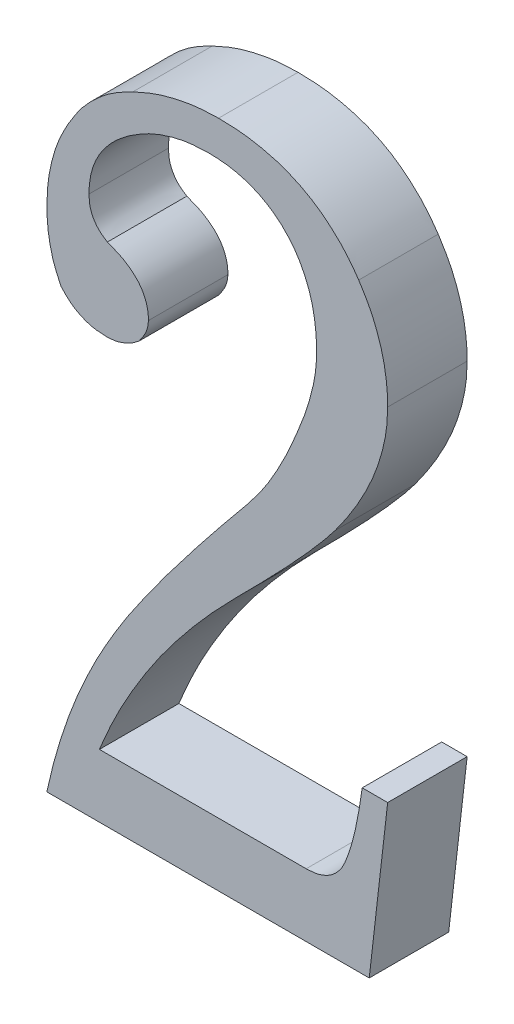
ISO-10303-21;
HEADER;
FILE_DESCRIPTION(('STEP AP214'),'2;1');
FILE_NAME('part.step','',(''),(''),'','','');
FILE_SCHEMA(('AUTOMOTIVE_DESIGN { 1 0 10303 214 1 1 1 1 }'));
ENDSEC;
DATA;
#1=APPLICATION_CONTEXT('core data for automotive mechanical design processes');
#2=APPLICATION_PROTOCOL_DEFINITION('international standard','automotive_design',2000,#1);
#3=PRODUCT_CONTEXT('',#1,'mechanical');
#4=PRODUCT('Part','Part','',(#3));
#5=PRODUCT_RELATED_PRODUCT_CATEGORY('part','',(#4));
#6=PRODUCT_DEFINITION_FORMATION('','',#4);
#7=PRODUCT_DEFINITION_CONTEXT('part definition',#1,'design');
#8=PRODUCT_DEFINITION('design','',#6,#7);
#9=PRODUCT_DEFINITION_SHAPE('','',#8);
#10=(LENGTH_UNIT() NAMED_UNIT(*) SI_UNIT(.MILLI.,.METRE.));
#11=(NAMED_UNIT(*) PLANE_ANGLE_UNIT() SI_UNIT($,.RADIAN.));
#12=(NAMED_UNIT(*) SI_UNIT($,.STERADIAN.) SOLID_ANGLE_UNIT());
#13=UNCERTAINTY_MEASURE_WITH_UNIT(LENGTH_MEASURE(1.E-05),#10,'distance_accuracy_value','');
#14=(GEOMETRIC_REPRESENTATION_CONTEXT(3) GLOBAL_UNCERTAINTY_ASSIGNED_CONTEXT((#13)) GLOBAL_UNIT_ASSIGNED_CONTEXT((#10,
#11,#12)) REPRESENTATION_CONTEXT('',''));
#15=CARTESIAN_POINT('',(0.,0.,0.));
#16=DIRECTION('',(0.,0.,1.));
#17=DIRECTION('',(1.,0.,0.));
#18=AXIS2_PLACEMENT_3D('',#15,#16,#17);
#19=CARTESIAN_POINT('',(5.2273172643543,23.1824417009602,3.));
#20=CARTESIAN_POINT('',(5.48603705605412,23.3002619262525,3.));
#21=CARTESIAN_POINT('',(5.99905611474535,23.5338892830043,3.));
#22=CARTESIAN_POINT('',(6.80944230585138,23.7631870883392,3.));
#23=CARTESIAN_POINT('',(7.63208492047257,23.9131077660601,3.));
#24=CARTESIAN_POINT('',(8.18733446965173,23.9322203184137,3.));
#25=CARTESIAN_POINT('',(8.46560846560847,23.9417989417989,3.));
#26=B_SPLINE_CURVE_WITH_KNOTS('',3,(#19,#20,#21,#22,#23,#24,#25),.UNSPECIFIED.,.F.,.F.,(4,1,1,1,
4),(0.,0.253972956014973,0.503606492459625,0.751222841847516,1.),.UNSPECIFIED.);
#27=DIRECTION('',(0.,0.,-1.));
#28=VECTOR('',#27,1.);
#29=SURFACE_OF_LINEAR_EXTRUSION('',#26,#28);
#30=CARTESIAN_POINT('',(5.2273172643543,23.1824417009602,0.));
#31=CARTESIAN_POINT('',(5.48603705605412,23.3002619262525,0.));
#32=CARTESIAN_POINT('',(5.99905611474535,23.5338892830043,0.));
#33=CARTESIAN_POINT('',(6.80944230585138,23.7631870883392,0.));
#34=CARTESIAN_POINT('',(7.63208492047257,23.9131077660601,0.));
#35=CARTESIAN_POINT('',(8.18733446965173,23.9322203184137,0.));
#36=CARTESIAN_POINT('',(8.46560846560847,23.9417989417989,0.));
#37=B_SPLINE_CURVE_WITH_KNOTS('',3,(#30,#31,#32,#33,#34,#35,#36),.UNSPECIFIED.,.F.,.F.,(4,1,1,1,
4),(0.,0.253972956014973,0.503606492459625,0.751222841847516,1.),.UNSPECIFIED.);
#38=CARTESIAN_POINT('',(5.2273172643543,23.1824417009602,0.));
#39=VERTEX_POINT('',#38);
#40=CARTESIAN_POINT('',(8.46560846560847,23.9417989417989,0.));
#41=VERTEX_POINT('',#40);
#42=EDGE_CURVE('E534',#39,#41,#37,.T.);
#43=ORIENTED_EDGE('',*,*,#42,.F.);
#44=DIRECTION('',(0.,0.,-1.));
#45=VECTOR('',#44,1.);
#46=CARTESIAN_POINT('',(5.2273172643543,23.1824417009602,3.));
#47=LINE('',#46,#45);
#48=CARTESIAN_POINT('',(5.2273172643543,23.1824417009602,3.));
#49=VERTEX_POINT('',#48);
#50=EDGE_CURVE('E11',#49,#39,#47,.T.);
#51=ORIENTED_EDGE('',*,*,#50,.F.);
#52=CARTESIAN_POINT('',(8.46560846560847,23.9417989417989,3.));
#53=VERTEX_POINT('',#52);
#54=EDGE_CURVE('E564',#49,#53,#26,.T.);
#55=ORIENTED_EDGE('',*,*,#54,.T.);
#56=DIRECTION('',(0.,0.,-1.));
#57=VECTOR('',#56,1.);
#58=CARTESIAN_POINT('',(8.46560846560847,23.9417989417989,3.));
#59=LINE('',#58,#57);
#60=EDGE_CURVE('E43',#53,#41,#59,.T.);
#61=ORIENTED_EDGE('',*,*,#60,.T.);
#62=EDGE_LOOP('',(#43,#51,#55,#61));
#63=FACE_BOUND('',#62,.T.);
#64=ADVANCED_FACE('F39',(#63),#29,.T.);
#65=CARTESIAN_POINT('',(2.77777777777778,20.8994708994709,3.));
#66=CARTESIAN_POINT('',(2.92811747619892,21.1470712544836,3.));
#67=CARTESIAN_POINT('',(3.22458977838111,21.6353431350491,3.));
#68=CARTESIAN_POINT('',(3.80636027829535,22.2599317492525,3.));
#69=CARTESIAN_POINT('',(4.46782646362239,22.7946283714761,3.));
#70=CARTESIAN_POINT('',(4.97212748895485,23.0521359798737,3.));
#71=CARTESIAN_POINT('',(5.2273172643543,23.1824417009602,3.));
#72=B_SPLINE_CURVE_WITH_KNOTS('',3,(#65,#66,#67,#68,#69,#70,#71),.UNSPECIFIED.,.F.,.F.,(4,1,1,1,
4),(0.,0.25466981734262,0.5022129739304,0.748106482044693,1.),.UNSPECIFIED.);
#73=DIRECTION('',(0.,0.,-1.));
#74=VECTOR('',#73,1.);
#75=SURFACE_OF_LINEAR_EXTRUSION('',#72,#74);
#76=CARTESIAN_POINT('',(2.77777777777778,20.8994708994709,0.));
#77=CARTESIAN_POINT('',(2.92811747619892,21.1470712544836,0.));
#78=CARTESIAN_POINT('',(3.22458977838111,21.6353431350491,0.));
#79=CARTESIAN_POINT('',(3.80636027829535,22.2599317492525,0.));
#80=CARTESIAN_POINT('',(4.46782646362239,22.7946283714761,0.));
#81=CARTESIAN_POINT('',(4.97212748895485,23.0521359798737,0.));
#82=CARTESIAN_POINT('',(5.2273172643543,23.1824417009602,0.));
#83=B_SPLINE_CURVE_WITH_KNOTS('',3,(#76,#77,#78,#79,#80,#81,#82),.UNSPECIFIED.,.F.,.F.,(4,1,1,1,
4),(0.,0.25466981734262,0.5022129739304,0.748106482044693,1.),.UNSPECIFIED.);
#84=CARTESIAN_POINT('',(2.77777777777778,20.8994708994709,0.));
#85=VERTEX_POINT('',#84);
#86=EDGE_CURVE('E562',#85,#39,#83,.T.);
#87=ORIENTED_EDGE('',*,*,#86,.F.);
#88=DIRECTION('',(0.,0.,-1.));
#89=VECTOR('',#88,1.);
#90=CARTESIAN_POINT('',(2.77777777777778,20.8994708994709,3.));
#91=LINE('',#90,#89);
#92=CARTESIAN_POINT('',(2.77777777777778,20.8994708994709,3.));
#93=VERTEX_POINT('',#92);
#94=EDGE_CURVE('E50',#93,#85,#91,.T.);
#95=ORIENTED_EDGE('',*,*,#94,.F.);
#96=EDGE_CURVE('E249',#93,#49,#72,.T.);
#97=ORIENTED_EDGE('',*,*,#96,.T.);
#98=ORIENTED_EDGE('',*,*,#50,.T.);
#99=EDGE_LOOP('',(#87,#95,#97,#98));
#100=FACE_BOUND('',#99,.T.);
#101=ADVANCED_FACE('F541',(#100),#75,.T.);
#102=CARTESIAN_POINT('',(1.98412698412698,17.8228493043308,3.));
#103=CARTESIAN_POINT('',(1.99248748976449,18.0996847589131,3.));
#104=CARTESIAN_POINT('',(2.00894487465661,18.6446263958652,3.));
#105=CARTESIAN_POINT('',(2.17074452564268,19.4380549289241,3.));
#106=CARTESIAN_POINT('',(2.40795245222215,20.199386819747,3.));
#107=CARTESIAN_POINT('',(2.65437860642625,20.6658746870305,3.));
#108=CARTESIAN_POINT('',(2.77777777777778,20.8994708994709,3.));
#109=B_SPLINE_CURVE_WITH_KNOTS('',3,(#102,#103,#104,#105,#106,#107,#108),.UNSPECIFIED.,.F.,.F.,
(4,1,1,1,4),(0.,0.258204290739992,0.508266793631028,0.753762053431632,1.),.UNSPECIFIED.);
#110=DIRECTION('',(0.,0.,-1.));
#111=VECTOR('',#110,1.);
#112=SURFACE_OF_LINEAR_EXTRUSION('',#109,#111);
#113=CARTESIAN_POINT('',(1.98412698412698,17.8228493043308,0.));
#114=CARTESIAN_POINT('',(1.99248748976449,18.0996847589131,0.));
#115=CARTESIAN_POINT('',(2.00894487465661,18.6446263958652,0.));
#116=CARTESIAN_POINT('',(2.17074452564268,19.4380549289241,0.));
#117=CARTESIAN_POINT('',(2.40795245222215,20.199386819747,0.));
#118=CARTESIAN_POINT('',(2.65437860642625,20.6658746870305,0.));
#119=CARTESIAN_POINT('',(2.77777777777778,20.8994708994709,0.));
#120=B_SPLINE_CURVE_WITH_KNOTS('',3,(#113,#114,#115,#116,#117,#118,#119),.UNSPECIFIED.,.F.,.F.,
(4,1,1,1,4),(0.,0.258204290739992,0.508266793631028,0.753762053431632,1.),.UNSPECIFIED.);
#121=CARTESIAN_POINT('',(1.98412698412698,17.8228493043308,0.));
#122=VERTEX_POINT('',#121);
#123=EDGE_CURVE('E235',#122,#85,#120,.T.);
#124=ORIENTED_EDGE('',*,*,#123,.F.);
#125=DIRECTION('',(0.,0.,-1.));
#126=VECTOR('',#125,1.);
#127=CARTESIAN_POINT('',(1.98412698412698,17.8228493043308,3.));
#128=LINE('',#127,#126);
#129=CARTESIAN_POINT('',(1.98412698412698,17.8228493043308,3.));
#130=VERTEX_POINT('',#129);
#131=EDGE_CURVE('E230',#130,#122,#128,.T.);
#132=ORIENTED_EDGE('',*,*,#131,.F.);
#133=EDGE_CURVE('E233',#130,#93,#109,.T.);
#134=ORIENTED_EDGE('',*,*,#133,.T.);
#135=ORIENTED_EDGE('',*,*,#94,.T.);
#136=EDGE_LOOP('',(#124,#132,#134,#135));
#137=FACE_BOUND('',#136,.T.);
#138=ADVANCED_FACE('F232',(#137),#112,.T.);
#139=CARTESIAN_POINT('',(2.51322751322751,15.4761904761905,3.));
#140=CARTESIAN_POINT('',(2.43176738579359,15.6507174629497,3.));
#141=CARTESIAN_POINT('',(2.26670563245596,16.0043595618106,3.));
#142=CARTESIAN_POINT('',(2.10328423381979,16.5787034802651,3.));
#143=CARTESIAN_POINT('',(2.00392287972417,17.1890026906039,3.));
#144=CARTESIAN_POINT('',(1.99082059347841,17.6085260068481,3.));
#145=CARTESIAN_POINT('',(1.98412698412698,17.8228493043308,3.));
#146=B_SPLINE_CURVE_WITH_KNOTS('',3,(#139,#140,#141,#142,#143,#144,#145),.UNSPECIFIED.,.F.,.F.,
(4,1,1,1,4),(0.,0.237729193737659,0.481708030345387,0.735218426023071,1.),.UNSPECIFIED.);
#147=DIRECTION('',(0.,0.,-1.));
#148=VECTOR('',#147,1.);
#149=SURFACE_OF_LINEAR_EXTRUSION('',#146,#148);
#150=CARTESIAN_POINT('',(2.51322751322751,15.4761904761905,0.));
#151=CARTESIAN_POINT('',(2.43176738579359,15.6507174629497,0.));
#152=CARTESIAN_POINT('',(2.26670563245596,16.0043595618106,0.));
#153=CARTESIAN_POINT('',(2.10328423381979,16.5787034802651,0.));
#154=CARTESIAN_POINT('',(2.00392287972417,17.1890026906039,0.));
#155=CARTESIAN_POINT('',(1.99082059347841,17.6085260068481,0.));
#156=CARTESIAN_POINT('',(1.98412698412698,17.8228493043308,0.));
#157=B_SPLINE_CURVE_WITH_KNOTS('',3,(#150,#151,#152,#153,#154,#155,#156),.UNSPECIFIED.,.F.,.F.,
(4,1,1,1,4),(0.,0.237729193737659,0.481708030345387,0.735218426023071,1.),.UNSPECIFIED.);
#158=CARTESIAN_POINT('',(2.51322751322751,15.4761904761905,0.));
#159=VERTEX_POINT('',#158);
#160=EDGE_CURVE('E569',#159,#122,#157,.T.);
#161=ORIENTED_EDGE('',*,*,#160,.F.);
#162=DIRECTION('',(0.,0.,-1.));
#163=VECTOR('',#162,1.);
#164=CARTESIAN_POINT('',(2.51322751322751,15.4761904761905,3.));
#165=LINE('',#164,#163);
#166=CARTESIAN_POINT('',(2.51322751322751,15.4761904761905,3.));
#167=VERTEX_POINT('',#166);
#168=EDGE_CURVE('E241',#167,#159,#165,.T.);
#169=ORIENTED_EDGE('',*,*,#168,.F.);
#170=EDGE_CURVE('E247',#167,#130,#146,.T.);
#171=ORIENTED_EDGE('',*,*,#170,.T.);
#172=ORIENTED_EDGE('',*,*,#131,.T.);
#173=EDGE_LOOP('',(#161,#169,#171,#172));
#174=FACE_BOUND('',#173,.T.);
#175=ADVANCED_FACE('F252',(#174),#149,.T.);
#176=CARTESIAN_POINT('',(4.23280423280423,14.6825396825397,3.));
#177=CARTESIAN_POINT('',(4.06320648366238,14.6906899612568,3.));
#178=CARTESIAN_POINT('',(3.73294889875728,14.7065609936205,3.));
#179=CARTESIAN_POINT('',(3.26874129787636,14.8674008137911,3.));
#180=CARTESIAN_POINT('',(2.84861921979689,15.1165423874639,3.));
#181=CARTESIAN_POINT('',(2.62718511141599,15.3539911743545,3.));
#182=CARTESIAN_POINT('',(2.51322751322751,15.4761904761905,3.));
#183=B_SPLINE_CURVE_WITH_KNOTS('',3,(#176,#177,#178,#179,#180,#181,#182),.UNSPECIFIED.,.F.,.F.,
(4,1,1,1,4),(0.,0.259106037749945,0.504557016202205,0.745028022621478,1.),.UNSPECIFIED.);
#184=DIRECTION('',(0.,0.,-1.));
#185=VECTOR('',#184,1.);
#186=SURFACE_OF_LINEAR_EXTRUSION('',#183,#185);
#187=CARTESIAN_POINT('',(4.23280423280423,14.6825396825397,0.));
#188=CARTESIAN_POINT('',(4.06320648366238,14.6906899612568,0.));
#189=CARTESIAN_POINT('',(3.73294889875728,14.7065609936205,0.));
#190=CARTESIAN_POINT('',(3.26874129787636,14.8674008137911,0.));
#191=CARTESIAN_POINT('',(2.84861921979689,15.1165423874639,0.));
#192=CARTESIAN_POINT('',(2.62718511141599,15.3539911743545,0.));
#193=CARTESIAN_POINT('',(2.51322751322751,15.4761904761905,0.));
#194=B_SPLINE_CURVE_WITH_KNOTS('',3,(#187,#188,#189,#190,#191,#192,#193),.UNSPECIFIED.,.F.,.F.,
(4,1,1,1,4),(0.,0.259106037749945,0.504557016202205,0.745028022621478,1.),.UNSPECIFIED.);
#195=CARTESIAN_POINT('',(4.23280423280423,14.6825396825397,0.));
#196=VERTEX_POINT('',#195);
#197=EDGE_CURVE('E708',#196,#159,#194,.T.);
#198=ORIENTED_EDGE('',*,*,#197,.F.);
#199=DIRECTION('',(0.,0.,-1.));
#200=VECTOR('',#199,1.);
#201=CARTESIAN_POINT('',(4.23280423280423,14.6825396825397,3.));
#202=LINE('',#201,#200);
#203=CARTESIAN_POINT('',(4.23280423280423,14.6825396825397,3.));
#204=VERTEX_POINT('',#203);
#205=EDGE_CURVE('E584',#204,#196,#202,.T.);
#206=ORIENTED_EDGE('',*,*,#205,.F.);
#207=EDGE_CURVE('E254',#204,#167,#183,.T.);
#208=ORIENTED_EDGE('',*,*,#207,.T.);
#209=ORIENTED_EDGE('',*,*,#168,.T.);
#210=EDGE_LOOP('',(#198,#206,#208,#209));
#211=FACE_BOUND('',#210,.T.);
#212=ADVANCED_FACE('F277',(#211),#186,.T.);
#213=CARTESIAN_POINT('',(5.45757397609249,15.1479521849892,3.));
#214=CARTESIAN_POINT('',(5.36366999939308,15.0754361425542,3.));
#215=CARTESIAN_POINT('',(5.18218926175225,14.9352901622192,3.));
#216=CARTESIAN_POINT('',(4.87410291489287,14.7935104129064,3.));
#217=CARTESIAN_POINT('',(4.55849853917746,14.6991158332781,3.));
#218=CARTESIAN_POINT('',(4.34125395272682,14.6880592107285,3.));
#219=CARTESIAN_POINT('',(4.23280423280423,14.6825396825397,3.));
#220=B_SPLINE_CURVE_WITH_KNOTS('',3,(#213,#214,#215,#216,#217,#218,#219),.UNSPECIFIED.,.F.,.F.,
(4,1,1,1,4),(0.,0.265555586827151,0.513218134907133,0.756995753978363,1.),.UNSPECIFIED.);
#221=DIRECTION('',(0.,0.,-1.));
#222=VECTOR('',#221,1.);
#223=SURFACE_OF_LINEAR_EXTRUSION('',#220,#222);
#224=CARTESIAN_POINT('',(5.45757397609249,15.1479521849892,0.));
#225=CARTESIAN_POINT('',(5.36366999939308,15.0754361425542,0.));
#226=CARTESIAN_POINT('',(5.18218926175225,14.9352901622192,0.));
#227=CARTESIAN_POINT('',(4.87410291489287,14.7935104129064,0.));
#228=CARTESIAN_POINT('',(4.55849853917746,14.6991158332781,0.));
#229=CARTESIAN_POINT('',(4.34125395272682,14.6880592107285,0.));
#230=CARTESIAN_POINT('',(4.23280423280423,14.6825396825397,0.));
#231=B_SPLINE_CURVE_WITH_KNOTS('',3,(#224,#225,#226,#227,#228,#229,#230),.UNSPECIFIED.,.F.,.F.,
(4,1,1,1,4),(0.,0.265555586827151,0.513218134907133,0.756995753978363,1.),.UNSPECIFIED.);
#232=CARTESIAN_POINT('',(5.45757397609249,15.1479521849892,0.));
#233=VERTEX_POINT('',#232);
#234=EDGE_CURVE('E699',#233,#196,#231,.T.);
#235=ORIENTED_EDGE('',*,*,#234,.F.);
#236=DIRECTION('',(0.,0.,-1.));
#237=VECTOR('',#236,1.);
#238=CARTESIAN_POINT('',(5.45757397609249,15.1479521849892,3.));
#239=LINE('',#238,#237);
#240=CARTESIAN_POINT('',(5.45757397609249,15.1479521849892,3.));
#241=VERTEX_POINT('',#240);
#242=EDGE_CURVE('E587',#241,#233,#239,.T.);
#243=ORIENTED_EDGE('',*,*,#242,.F.);
#244=EDGE_CURVE('E257',#241,#204,#220,.T.);
#245=ORIENTED_EDGE('',*,*,#244,.T.);
#246=ORIENTED_EDGE('',*,*,#205,.T.);
#247=EDGE_LOOP('',(#235,#243,#245,#246));
#248=FACE_BOUND('',#247,.T.);
#249=ADVANCED_FACE('F281',(#248),#223,.T.);
#250=CARTESIAN_POINT('',(5.82010582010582,16.005291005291,3.));
#251=CARTESIAN_POINT('',(5.81417019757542,15.9379847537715,3.));
#252=CARTESIAN_POINT('',(5.80177896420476,15.7974759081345,3.));
#253=CARTESIAN_POINT('',(5.73566858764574,15.5811881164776,3.));
#254=CARTESIAN_POINT('',(5.61425227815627,15.3633548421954,3.));
#255=CARTESIAN_POINT('',(5.51141283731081,15.2219703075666,3.));
#256=CARTESIAN_POINT('',(5.45757397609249,15.1479521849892,3.));
#257=B_SPLINE_CURVE_WITH_KNOTS('',3,(#250,#251,#252,#253,#254,#255,#256),.UNSPECIFIED.,.F.,.F.,
(4,1,1,1,4),(0.,0.213719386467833,0.44616159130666,0.710052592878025,1.),.UNSPECIFIED.);
#258=DIRECTION('',(0.,0.,-1.));
#259=VECTOR('',#258,1.);
#260=SURFACE_OF_LINEAR_EXTRUSION('',#257,#259);
#261=CARTESIAN_POINT('',(5.82010582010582,16.005291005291,0.));
#262=CARTESIAN_POINT('',(5.81417019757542,15.9379847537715,0.));
#263=CARTESIAN_POINT('',(5.80177896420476,15.7974759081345,0.));
#264=CARTESIAN_POINT('',(5.73566858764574,15.5811881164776,0.));
#265=CARTESIAN_POINT('',(5.61425227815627,15.3633548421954,0.));
#266=CARTESIAN_POINT('',(5.51141283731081,15.2219703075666,0.));
#267=CARTESIAN_POINT('',(5.45757397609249,15.1479521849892,0.));
#268=B_SPLINE_CURVE_WITH_KNOTS('',3,(#261,#262,#263,#264,#265,#266,#267),.UNSPECIFIED.,.F.,.F.,
(4,1,1,1,4),(0.,0.213719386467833,0.44616159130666,0.710052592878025,1.),.UNSPECIFIED.);
#269=CARTESIAN_POINT('',(5.82010582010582,16.005291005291,0.));
#270=VERTEX_POINT('',#269);
#271=EDGE_CURVE('E690',#270,#233,#268,.T.);
#272=ORIENTED_EDGE('',*,*,#271,.F.);
#273=DIRECTION('',(0.,0.,-1.));
#274=VECTOR('',#273,1.);
#275=CARTESIAN_POINT('',(5.82010582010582,16.005291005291,3.));
#276=LINE('',#275,#274);
#277=CARTESIAN_POINT('',(5.82010582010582,16.005291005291,3.));
#278=VERTEX_POINT('',#277);
#279=EDGE_CURVE('E590',#278,#270,#276,.T.);
#280=ORIENTED_EDGE('',*,*,#279,.F.);
#281=EDGE_CURVE('E294',#278,#241,#257,.T.);
#282=ORIENTED_EDGE('',*,*,#281,.T.);
#283=ORIENTED_EDGE('',*,*,#242,.T.);
#284=EDGE_LOOP('',(#272,#280,#282,#283));
#285=FACE_BOUND('',#284,.T.);
#286=ADVANCED_FACE('F285',(#285),#260,.T.);
#287=CARTESIAN_POINT('',(4.26709778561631,17.7934548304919,3.));
#288=CARTESIAN_POINT('',(4.38896162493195,17.7486420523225,3.));
#289=CARTESIAN_POINT('',(4.62329914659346,17.6624695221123,3.));
#290=CARTESIAN_POINT('',(4.94352443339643,17.4982035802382,3.));
#291=CARTESIAN_POINT('',(5.21073710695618,17.3029644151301,3.));
#292=CARTESIAN_POINT('',(5.43753721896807,17.0945243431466,3.));
#293=CARTESIAN_POINT('',(5.60642096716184,16.8520980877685,3.));
#294=CARTESIAN_POINT('',(5.73041405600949,16.5909825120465,3.));
#295=CARTESIAN_POINT('',(5.80725347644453,16.3051454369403,3.));
#296=CARTESIAN_POINT('',(5.81574551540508,16.1070200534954,3.));
#297=CARTESIAN_POINT('',(5.82010582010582,16.005291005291,3.));
#298=B_SPLINE_CURVE_WITH_KNOTS('',3,(#287,#288,#289,#290,#291,#292,#293,#294,#295,#296,#297),
.UNSPECIFIED.,.F.,.F.,(4,1,1,1,1,1,1,1,4),(0.,0.152771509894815,0.293771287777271,
0.42180715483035,0.541444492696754,0.654508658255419,0.767147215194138,0.880439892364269,1.),.UNSPECIFIED.);
#299=DIRECTION('',(0.,0.,-1.));
#300=VECTOR('',#299,1.);
#301=SURFACE_OF_LINEAR_EXTRUSION('',#298,#300);
#302=CARTESIAN_POINT('',(4.26709778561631,17.7934548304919,0.));
#303=CARTESIAN_POINT('',(4.38896162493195,17.7486420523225,0.));
#304=CARTESIAN_POINT('',(4.62329914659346,17.6624695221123,0.));
#305=CARTESIAN_POINT('',(4.94352443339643,17.4982035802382,0.));
#306=CARTESIAN_POINT('',(5.21073710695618,17.3029644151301,0.));
#307=CARTESIAN_POINT('',(5.43753721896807,17.0945243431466,0.));
#308=CARTESIAN_POINT('',(5.60642096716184,16.8520980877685,0.));
#309=CARTESIAN_POINT('',(5.73041405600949,16.5909825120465,0.));
#310=CARTESIAN_POINT('',(5.80725347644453,16.3051454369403,0.));
#311=CARTESIAN_POINT('',(5.81574551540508,16.1070200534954,0.));
#312=CARTESIAN_POINT('',(5.82010582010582,16.005291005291,0.));
#313=B_SPLINE_CURVE_WITH_KNOTS('',3,(#302,#303,#304,#305,#306,#307,#308,#309,#310,#311,#312),
.UNSPECIFIED.,.F.,.F.,(4,1,1,1,1,1,1,1,4),(0.,0.152771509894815,0.293771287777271,
0.42180715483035,0.541444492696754,0.654508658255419,0.767147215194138,0.880439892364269,1.),.UNSPECIFIED.);
#314=CARTESIAN_POINT('',(4.2670977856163,17.7934548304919,0.));
#315=VERTEX_POINT('',#314);
#316=EDGE_CURVE('E681',#315,#270,#313,.T.);
#317=ORIENTED_EDGE('',*,*,#316,.F.);
#318=DIRECTION('',(0.,0.,-1.));
#319=VECTOR('',#318,1.);
#320=CARTESIAN_POINT('',(4.2670977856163,17.7934548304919,3.));
#321=LINE('',#320,#319);
#322=CARTESIAN_POINT('',(4.2670977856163,17.7934548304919,3.));
#323=VERTEX_POINT('',#322);
#324=EDGE_CURVE('E593',#323,#315,#321,.T.);
#325=ORIENTED_EDGE('',*,*,#324,.F.);
#326=EDGE_CURVE('E304',#323,#278,#298,.T.);
#327=ORIENTED_EDGE('',*,*,#326,.T.);
#328=ORIENTED_EDGE('',*,*,#279,.T.);
#329=EDGE_LOOP('',(#317,#325,#327,#328));
#330=FACE_BOUND('',#329,.T.);
#331=ADVANCED_FACE('F322',(#330),#301,.T.);
#332=CARTESIAN_POINT('',(3.57142857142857,19.013325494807,3.));
#333=CARTESIAN_POINT('',(3.57850900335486,18.8827756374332,3.));
#334=CARTESIAN_POINT('',(3.59202200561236,18.6336212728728,3.));
#335=CARTESIAN_POINT('',(3.73467109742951,18.2910634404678,3.));
#336=CARTESIAN_POINT('',(3.95529429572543,17.997014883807,3.));
#337=CARTESIAN_POINT('',(4.16077890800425,17.8628648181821,3.));
#338=CARTESIAN_POINT('',(4.2670977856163,17.7934548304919,3.));
#339=B_SPLINE_CURVE_WITH_KNOTS('',3,(#332,#333,#334,#335,#336,#337,#338),.UNSPECIFIED.,.F.,.F.,
(4,1,1,1,4),(0.,0.264195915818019,0.504217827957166,0.743479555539,1.),.UNSPECIFIED.);
#340=DIRECTION('',(0.,0.,-1.));
#341=VECTOR('',#340,1.);
#342=SURFACE_OF_LINEAR_EXTRUSION('',#339,#341);
#343=CARTESIAN_POINT('',(3.57142857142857,19.013325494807,0.));
#344=CARTESIAN_POINT('',(3.57850900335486,18.8827756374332,0.));
#345=CARTESIAN_POINT('',(3.59202200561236,18.6336212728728,0.));
#346=CARTESIAN_POINT('',(3.73467109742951,18.2910634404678,0.));
#347=CARTESIAN_POINT('',(3.95529429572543,17.997014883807,0.));
#348=CARTESIAN_POINT('',(4.16077890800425,17.8628648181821,0.));
#349=CARTESIAN_POINT('',(4.2670977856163,17.7934548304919,0.));
#350=B_SPLINE_CURVE_WITH_KNOTS('',3,(#343,#344,#345,#346,#347,#348,#349),.UNSPECIFIED.,.F.,.F.,
(4,1,1,1,4),(0.,0.264195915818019,0.504217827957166,0.743479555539,1.),.UNSPECIFIED.);
#351=CARTESIAN_POINT('',(3.57142857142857,19.013325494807,0.));
#352=VERTEX_POINT('',#351);
#353=EDGE_CURVE('E672',#352,#315,#350,.T.);
#354=ORIENTED_EDGE('',*,*,#353,.F.);
#355=DIRECTION('',(0.,0.,-1.));
#356=VECTOR('',#355,1.);
#357=CARTESIAN_POINT('',(3.57142857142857,19.013325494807,3.));
#358=LINE('',#357,#356);
#359=CARTESIAN_POINT('',(3.57142857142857,19.013325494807,3.));
#360=VERTEX_POINT('',#359);
#361=EDGE_CURVE('E596',#360,#352,#358,.T.);
#362=ORIENTED_EDGE('',*,*,#361,.F.);
#363=EDGE_CURVE('E314',#360,#323,#339,.T.);
#364=ORIENTED_EDGE('',*,*,#363,.T.);
#365=ORIENTED_EDGE('',*,*,#324,.T.);
#366=EDGE_LOOP('',(#354,#362,#364,#365));
#367=FACE_BOUND('',#366,.T.);
#368=ADVANCED_FACE('F325',(#367),#342,.T.);
#369=CARTESIAN_POINT('',(5.0607485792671,21.6588281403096,3.));
#370=CARTESIAN_POINT('',(4.9430294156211,21.5695415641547,3.));
#371=CARTESIAN_POINT('',(4.71389260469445,21.3957479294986,3.));
#372=CARTESIAN_POINT('',(4.40885167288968,21.1061687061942,3.));
#373=CARTESIAN_POINT('',(4.15031823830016,20.7991985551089,3.));
#374=CARTESIAN_POINT('',(3.93803724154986,20.4758602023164,3.));
#375=CARTESIAN_POINT('',(3.77458146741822,20.1326773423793,3.));
#376=CARTESIAN_POINT('',(3.65602766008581,19.7742208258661,3.));
#377=CARTESIAN_POINT('',(3.58639214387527,19.3981304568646,3.));
#378=CARTESIAN_POINT('',(3.57645621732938,19.142617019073,3.));
#379=CARTESIAN_POINT('',(3.57142857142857,19.013325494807,3.));
#380=B_SPLINE_CURVE_WITH_KNOTS('',3,(#369,#370,#371,#372,#373,#374,#375,#376,#377,#378,#379),
.UNSPECIFIED.,.F.,.F.,(4,1,1,1,1,1,1,1,4),(0.,0.140094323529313,0.272689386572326,
0.398054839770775,0.52009265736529,0.638588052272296,0.757639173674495,0.877363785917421,1.),.UNSPECIFIED.);
#381=DIRECTION('',(0.,0.,-1.));
#382=VECTOR('',#381,1.);
#383=SURFACE_OF_LINEAR_EXTRUSION('',#380,#382);
#384=CARTESIAN_POINT('',(5.0607485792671,21.6588281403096,0.));
#385=CARTESIAN_POINT('',(4.9430294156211,21.5695415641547,0.));
#386=CARTESIAN_POINT('',(4.71389260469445,21.3957479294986,0.));
#387=CARTESIAN_POINT('',(4.40885167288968,21.1061687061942,0.));
#388=CARTESIAN_POINT('',(4.15031823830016,20.7991985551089,0.));
#389=CARTESIAN_POINT('',(3.93803724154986,20.4758602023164,0.));
#390=CARTESIAN_POINT('',(3.77458146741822,20.1326773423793,0.));
#391=CARTESIAN_POINT('',(3.65602766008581,19.7742208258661,0.));
#392=CARTESIAN_POINT('',(3.58639214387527,19.3981304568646,0.));
#393=CARTESIAN_POINT('',(3.57645621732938,19.142617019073,0.));
#394=CARTESIAN_POINT('',(3.57142857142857,19.013325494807,0.));
#395=B_SPLINE_CURVE_WITH_KNOTS('',3,(#384,#385,#386,#387,#388,#389,#390,#391,#392,#393,#394),
.UNSPECIFIED.,.F.,.F.,(4,1,1,1,1,1,1,1,4),(0.,0.140094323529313,0.272689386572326,
0.398054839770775,0.52009265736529,0.638588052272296,0.757639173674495,0.877363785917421,1.),.UNSPECIFIED.);
#396=CARTESIAN_POINT('',(5.0607485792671,21.6588281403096,0.));
#397=VERTEX_POINT('',#396);
#398=EDGE_CURVE('E663',#397,#352,#395,.T.);
#399=ORIENTED_EDGE('',*,*,#398,.F.);
#400=DIRECTION('',(0.,0.,-1.));
#401=VECTOR('',#400,1.);
#402=CARTESIAN_POINT('',(5.0607485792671,21.6588281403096,3.));
#403=LINE('',#402,#401);
#404=CARTESIAN_POINT('',(5.0607485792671,21.6588281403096,3.));
#405=VERTEX_POINT('',#404);
#406=EDGE_CURVE('E599',#405,#397,#403,.T.);
#407=ORIENTED_EDGE('',*,*,#406,.F.);
#408=EDGE_CURVE('E337',#405,#360,#380,.T.);
#409=ORIENTED_EDGE('',*,*,#408,.T.);
#410=ORIENTED_EDGE('',*,*,#361,.T.);
#411=EDGE_LOOP('',(#399,#407,#409,#410));
#412=FACE_BOUND('',#411,.T.);
#413=ADVANCED_FACE('F329',(#412),#383,.T.);
#414=CARTESIAN_POINT('',(8.06878306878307,22.6190476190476,3.));
#415=CARTESIAN_POINT('',(7.79814868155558,22.6087438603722,3.));
#416=CARTESIAN_POINT('',(7.26364402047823,22.5883938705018,3.));
#417=CARTESIAN_POINT('',(6.48498158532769,22.3953259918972,3.));
#418=CARTESIAN_POINT('',(5.73759803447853,22.1012486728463,3.));
#419=CARTESIAN_POINT('',(5.28823002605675,21.8075206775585,3.));
#420=CARTESIAN_POINT('',(5.0607485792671,21.6588281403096,3.));
#421=B_SPLINE_CURVE_WITH_KNOTS('',3,(#414,#415,#416,#417,#418,#419,#420),.UNSPECIFIED.,.F.,.F.,
(4,1,1,1,4),(0.,0.252698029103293,0.499080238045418,0.746421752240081,1.),.UNSPECIFIED.);
#422=DIRECTION('',(0.,0.,-1.));
#423=VECTOR('',#422,1.);
#424=SURFACE_OF_LINEAR_EXTRUSION('',#421,#423);
#425=CARTESIAN_POINT('',(8.06878306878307,22.6190476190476,0.));
#426=CARTESIAN_POINT('',(7.79814868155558,22.6087438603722,0.));
#427=CARTESIAN_POINT('',(7.26364402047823,22.5883938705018,0.));
#428=CARTESIAN_POINT('',(6.48498158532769,22.3953259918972,0.));
#429=CARTESIAN_POINT('',(5.73759803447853,22.1012486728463,0.));
#430=CARTESIAN_POINT('',(5.28823002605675,21.8075206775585,0.));
#431=CARTESIAN_POINT('',(5.0607485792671,21.6588281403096,0.));
#432=B_SPLINE_CURVE_WITH_KNOTS('',3,(#425,#426,#427,#428,#429,#430,#431),.UNSPECIFIED.,.F.,.F.,
(4,1,1,1,4),(0.,0.252698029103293,0.499080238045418,0.746421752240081,1.),.UNSPECIFIED.);
#433=CARTESIAN_POINT('',(8.06878306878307,22.6190476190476,0.));
#434=VERTEX_POINT('',#433);
#435=EDGE_CURVE('E654',#434,#397,#432,.T.);
#436=ORIENTED_EDGE('',*,*,#435,.F.);
#437=DIRECTION('',(0.,0.,-1.));
#438=VECTOR('',#437,1.);
#439=CARTESIAN_POINT('',(8.06878306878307,22.6190476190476,3.));
#440=LINE('',#439,#438);
#441=CARTESIAN_POINT('',(8.06878306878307,22.6190476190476,3.));
#442=VERTEX_POINT('',#441);
#443=EDGE_CURVE('E602',#442,#434,#440,.T.);
#444=ORIENTED_EDGE('',*,*,#443,.F.);
#445=EDGE_CURVE('E343',#442,#405,#421,.T.);
#446=ORIENTED_EDGE('',*,*,#445,.T.);
#447=ORIENTED_EDGE('',*,*,#406,.T.);
#448=EDGE_LOOP('',(#436,#444,#446,#447));
#449=FACE_BOUND('',#448,.T.);
#450=ADVANCED_FACE('F333',(#449),#424,.T.);
#451=CARTESIAN_POINT('',(11.1454046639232,21.3305898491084,3.));
#452=CARTESIAN_POINT('',(11.0498777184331,21.4343718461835,3.));
#453=CARTESIAN_POINT('',(10.8614917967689,21.6390373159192,3.));
#454=CARTESIAN_POINT('',(10.5372486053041,21.9006383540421,3.));
#455=CARTESIAN_POINT('',(10.1882857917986,22.1215129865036,3.));
#456=CARTESIAN_POINT('',(9.81355780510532,22.3038196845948,3.));
#457=CARTESIAN_POINT('',(9.41419444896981,22.44582995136,3.));
#458=CARTESIAN_POINT('',(8.98946670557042,22.5502322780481,3.));
#459=CARTESIAN_POINT('',(8.5374389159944,22.6080100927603,3.));
#460=CARTESIAN_POINT('',(8.22734440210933,22.6153132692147,3.));
#461=CARTESIAN_POINT('',(8.06878306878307,22.6190476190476,3.));
#462=B_SPLINE_CURVE_WITH_KNOTS('',3,(#451,#452,#453,#454,#455,#456,#457,#458,#459,#460,#461),
.UNSPECIFIED.,.F.,.F.,(4,1,1,1,1,1,1,1,4),(0.,0.122701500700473,0.241976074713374,
0.361521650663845,0.481733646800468,0.604088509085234,0.729987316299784,0.861933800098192,1.),.UNSPECIFIED.);
#463=DIRECTION('',(0.,0.,-1.));
#464=VECTOR('',#463,1.);
#465=SURFACE_OF_LINEAR_EXTRUSION('',#462,#464);
#466=CARTESIAN_POINT('',(11.1454046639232,21.3305898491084,0.));
#467=CARTESIAN_POINT('',(11.0498777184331,21.4343718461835,0.));
#468=CARTESIAN_POINT('',(10.8614917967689,21.6390373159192,0.));
#469=CARTESIAN_POINT('',(10.5372486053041,21.9006383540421,0.));
#470=CARTESIAN_POINT('',(10.1882857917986,22.1215129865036,0.));
#471=CARTESIAN_POINT('',(9.81355780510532,22.3038196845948,0.));
#472=CARTESIAN_POINT('',(9.41419444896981,22.44582995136,0.));
#473=CARTESIAN_POINT('',(8.98946670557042,22.5502322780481,0.));
#474=CARTESIAN_POINT('',(8.5374389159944,22.6080100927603,0.));
#475=CARTESIAN_POINT('',(8.22734440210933,22.6153132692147,0.));
#476=CARTESIAN_POINT('',(8.06878306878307,22.6190476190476,0.));
#477=B_SPLINE_CURVE_WITH_KNOTS('',3,(#466,#467,#468,#469,#470,#471,#472,#473,#474,#475,#476),
.UNSPECIFIED.,.F.,.F.,(4,1,1,1,1,1,1,1,4),(0.,0.122701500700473,0.241976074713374,
0.361521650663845,0.481733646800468,0.604088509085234,0.729987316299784,0.861933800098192,1.),.UNSPECIFIED.);
#478=CARTESIAN_POINT('',(11.1454046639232,21.3305898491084,0.));
#479=VERTEX_POINT('',#478);
#480=EDGE_CURVE('E645',#479,#434,#477,.T.);
#481=ORIENTED_EDGE('',*,*,#480,.F.);
#482=DIRECTION('',(0.,0.,-1.));
#483=VECTOR('',#482,1.);
#484=CARTESIAN_POINT('',(11.1454046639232,21.3305898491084,3.));
#485=LINE('',#484,#483);
#486=CARTESIAN_POINT('',(11.1454046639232,21.3305898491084,3.));
#487=VERTEX_POINT('',#486);
#488=EDGE_CURVE('E605',#487,#479,#485,.T.);
#489=ORIENTED_EDGE('',*,*,#488,.F.);
#490=EDGE_CURVE('E353',#487,#442,#462,.T.);
#491=ORIENTED_EDGE('',*,*,#490,.T.);
#492=ORIENTED_EDGE('',*,*,#443,.T.);
#493=EDGE_LOOP('',(#481,#489,#491,#492));
#494=FACE_BOUND('',#493,.T.);
#495=ADVANCED_FACE('F371',(#494),#465,.T.);
#496=CARTESIAN_POINT('',(12.1693121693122,18.1216931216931,3.));
#497=CARTESIAN_POINT('',(12.1671148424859,18.2851433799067,3.));
#498=CARTESIAN_POINT('',(12.162819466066,18.6046590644,3.));
#499=CARTESIAN_POINT('',(12.1110666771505,19.071035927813,3.));
#500=CARTESIAN_POINT('',(12.0349942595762,19.5139440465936,3.));
#501=CARTESIAN_POINT('',(11.923262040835,19.9310743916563,3.));
#502=CARTESIAN_POINT('',(11.7745631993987,20.3205487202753,3.));
#503=CARTESIAN_POINT('',(11.5972384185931,20.6841525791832,3.));
#504=CARTESIAN_POINT('',(11.3944252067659,21.0264441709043,3.));
#505=CARTESIAN_POINT('',(11.2280782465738,21.2296149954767,3.));
#506=CARTESIAN_POINT('',(11.1454046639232,21.3305898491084,3.));
#507=B_SPLINE_CURVE_WITH_KNOTS('',3,(#496,#497,#498,#499,#500,#501,#502,#503,#504,#505,#506),
.UNSPECIFIED.,.F.,.F.,(4,1,1,1,1,1,1,1,4),(0.,0.14242817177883,0.27842130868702,
0.408558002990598,0.533919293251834,0.654223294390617,0.771377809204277,0.886375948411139,1.),.UNSPECIFIED.);
#508=DIRECTION('',(0.,0.,-1.));
#509=VECTOR('',#508,1.);
#510=SURFACE_OF_LINEAR_EXTRUSION('',#507,#509);
#511=CARTESIAN_POINT('',(12.1693121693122,18.1216931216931,0.));
#512=CARTESIAN_POINT('',(12.1671148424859,18.2851433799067,0.));
#513=CARTESIAN_POINT('',(12.162819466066,18.6046590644,0.));
#514=CARTESIAN_POINT('',(12.1110666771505,19.071035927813,0.));
#515=CARTESIAN_POINT('',(12.0349942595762,19.5139440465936,0.));
#516=CARTESIAN_POINT('',(11.923262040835,19.9310743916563,0.));
#517=CARTESIAN_POINT('',(11.7745631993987,20.3205487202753,0.));
#518=CARTESIAN_POINT('',(11.5972384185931,20.6841525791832,0.));
#519=CARTESIAN_POINT('',(11.3944252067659,21.0264441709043,0.));
#520=CARTESIAN_POINT('',(11.2280782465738,21.2296149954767,0.));
#521=CARTESIAN_POINT('',(11.1454046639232,21.3305898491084,0.));
#522=B_SPLINE_CURVE_WITH_KNOTS('',3,(#511,#512,#513,#514,#515,#516,#517,#518,#519,#520,#521),
.UNSPECIFIED.,.F.,.F.,(4,1,1,1,1,1,1,1,4),(0.,0.14242817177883,0.27842130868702,
0.408558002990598,0.533919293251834,0.654223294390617,0.771377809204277,0.886375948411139,1.),.UNSPECIFIED.);
#523=CARTESIAN_POINT('',(12.1693121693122,18.1216931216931,0.));
#524=VERTEX_POINT('',#523);
#525=EDGE_CURVE('E620',#524,#479,#522,.T.);
#526=ORIENTED_EDGE('',*,*,#525,.F.);
#527=DIRECTION('',(0.,0.,-1.));
#528=VECTOR('',#527,1.);
#529=CARTESIAN_POINT('',(12.1693121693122,18.1216931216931,3.));
#530=LINE('',#529,#528);
#531=CARTESIAN_POINT('',(12.1693121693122,18.1216931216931,3.));
#532=VERTEX_POINT('',#531);
#533=EDGE_CURVE('E608',#532,#524,#530,.T.);
#534=ORIENTED_EDGE('',*,*,#533,.F.);
#535=EDGE_CURVE('E363',#532,#487,#507,.T.);
#536=ORIENTED_EDGE('',*,*,#535,.T.);
#537=ORIENTED_EDGE('',*,*,#488,.T.);
#538=EDGE_LOOP('',(#526,#534,#536,#537));
#539=FACE_BOUND('',#538,.T.);
#540=ADVANCED_FACE('F374',(#539),#510,.T.);
#541=CARTESIAN_POINT('',(11.4442484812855,15.1773466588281,3.));
#542=CARTESIAN_POINT('',(11.5555125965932,15.4515532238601,3.));
#543=CARTESIAN_POINT('',(11.7673064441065,15.9735118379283,3.));
#544=CARTESIAN_POINT('',(11.9899401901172,16.7451296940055,3.));
#545=CARTESIAN_POINT('',(12.1411213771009,17.4528023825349,3.));
#546=CARTESIAN_POINT('',(12.1602685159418,17.9071118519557,3.));
#547=CARTESIAN_POINT('',(12.1693121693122,18.1216931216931,3.));
#548=B_SPLINE_CURVE_WITH_KNOTS('',3,(#541,#542,#543,#544,#545,#546,#547),.UNSPECIFIED.,.F.,.F.,
(4,1,1,1,4),(0.,0.290792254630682,0.553529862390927,0.789121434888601,1.),.UNSPECIFIED.);
#549=DIRECTION('',(0.,0.,-1.));
#550=VECTOR('',#549,1.);
#551=SURFACE_OF_LINEAR_EXTRUSION('',#548,#550);
#552=CARTESIAN_POINT('',(11.4442484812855,15.1773466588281,0.));
#553=CARTESIAN_POINT('',(11.5555125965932,15.4515532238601,0.));
#554=CARTESIAN_POINT('',(11.7673064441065,15.9735118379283,0.));
#555=CARTESIAN_POINT('',(11.9899401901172,16.7451296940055,0.));
#556=CARTESIAN_POINT('',(12.1411213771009,17.4528023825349,0.));
#557=CARTESIAN_POINT('',(12.1602685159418,17.9071118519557,0.));
#558=CARTESIAN_POINT('',(12.1693121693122,18.1216931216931,0.));
#559=B_SPLINE_CURVE_WITH_KNOTS('',3,(#552,#553,#554,#555,#556,#557,#558),.UNSPECIFIED.,.F.,.F.,
(4,1,1,1,4),(0.,0.290792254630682,0.553529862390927,0.789121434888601,1.),.UNSPECIFIED.);
#560=CARTESIAN_POINT('',(11.4442484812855,15.1773466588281,0.));
#561=VERTEX_POINT('',#560);
#562=EDGE_CURVE('E616',#561,#524,#559,.T.);
#563=ORIENTED_EDGE('',*,*,#562,.F.);
#564=DIRECTION('',(0.,0.,-1.));
#565=VECTOR('',#564,1.);
#566=CARTESIAN_POINT('',(11.4442484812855,15.1773466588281,3.));
#567=LINE('',#566,#565);
#568=CARTESIAN_POINT('',(11.4442484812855,15.1773466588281,3.));
#569=VERTEX_POINT('',#568);
#570=EDGE_CURVE('E494',#569,#561,#567,.T.);
#571=ORIENTED_EDGE('',*,*,#570,.F.);
#572=EDGE_CURVE('E386',#569,#532,#548,.T.);
#573=ORIENTED_EDGE('',*,*,#572,.T.);
#574=ORIENTED_EDGE('',*,*,#533,.T.);
#575=EDGE_LOOP('',(#563,#571,#573,#574));
#576=FACE_BOUND('',#575,.T.);
#577=ADVANCED_FACE('F378',(#576),#551,.T.);
#578=CARTESIAN_POINT('',(9.5581030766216,11.8704683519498,3.));
#579=CARTESIAN_POINT('',(9.73916111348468,12.1006787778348,3.));
#580=CARTESIAN_POINT('',(10.1117115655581,12.574366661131,3.));
#581=CARTESIAN_POINT('',(10.5939902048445,13.3691511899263,3.));
#582=CARTESIAN_POINT('',(11.0490873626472,14.2392065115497,3.));
#583=CARTESIAN_POINT('',(11.3099231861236,14.8584490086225,3.));
#584=CARTESIAN_POINT('',(11.4442484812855,15.1773466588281,3.));
#585=B_SPLINE_CURVE_WITH_KNOTS('',3,(#578,#579,#580,#581,#582,#583,#584),.UNSPECIFIED.,.F.,.F.,
(4,1,1,1,4),(0.,0.229740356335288,0.47272065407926,0.728461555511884,1.),.UNSPECIFIED.);
#586=DIRECTION('',(0.,0.,-1.));
#587=VECTOR('',#586,1.);
#588=SURFACE_OF_LINEAR_EXTRUSION('',#585,#587);
#589=CARTESIAN_POINT('',(9.5581030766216,11.8704683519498,0.));
#590=CARTESIAN_POINT('',(9.73916111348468,12.1006787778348,0.));
#591=CARTESIAN_POINT('',(10.1117115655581,12.574366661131,0.));
#592=CARTESIAN_POINT('',(10.5939902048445,13.3691511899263,0.));
#593=CARTESIAN_POINT('',(11.0490873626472,14.2392065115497,0.));
#594=CARTESIAN_POINT('',(11.3099231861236,14.8584490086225,0.));
#595=CARTESIAN_POINT('',(11.4442484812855,15.1773466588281,0.));
#596=B_SPLINE_CURVE_WITH_KNOTS('',3,(#589,#590,#591,#592,#593,#594,#595),.UNSPECIFIED.,.F.,.F.,
(4,1,1,1,4),(0.,0.229740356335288,0.47272065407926,0.728461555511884,1.),.UNSPECIFIED.);
#597=CARTESIAN_POINT('',(9.5581030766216,11.8704683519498,0.));
#598=VERTEX_POINT('',#597);
#599=EDGE_CURVE('E614',#598,#561,#596,.T.);
#600=ORIENTED_EDGE('',*,*,#599,.F.);
#601=DIRECTION('',(0.,0.,-1.));
#602=VECTOR('',#601,1.);
#603=CARTESIAN_POINT('',(9.5581030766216,11.8704683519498,3.));
#604=LINE('',#603,#602);
#605=CARTESIAN_POINT('',(9.5581030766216,11.8704683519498,3.));
#606=VERTEX_POINT('',#605);
#607=EDGE_CURVE('E485',#606,#598,#604,.T.);
#608=ORIENTED_EDGE('',*,*,#607,.F.);
#609=EDGE_CURVE('E392',#606,#569,#585,.T.);
#610=ORIENTED_EDGE('',*,*,#609,.T.);
#611=ORIENTED_EDGE('',*,*,#570,.T.);
#612=EDGE_LOOP('',(#600,#608,#610,#611));
#613=FACE_BOUND('',#612,.T.);
#614=ADVANCED_FACE('F382',(#613),#588,.T.);
#615=CARTESIAN_POINT('',(4.56594160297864,5.19302371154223,3.));
#616=CARTESIAN_POINT('',(4.69182301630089,5.39811242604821,3.));
#617=CARTESIAN_POINT('',(4.95869479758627,5.83290568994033,3.));
#618=CARTESIAN_POINT('',(5.41524472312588,6.50390193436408,3.));
#619=CARTESIAN_POINT('',(5.93326715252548,7.24305145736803,3.));
#620=CARTESIAN_POINT('',(6.52171591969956,8.04759253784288,3.));
#621=CARTESIAN_POINT('',(7.18483814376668,8.9110485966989,3.));
#622=CARTESIAN_POINT('',(7.90918838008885,9.8450835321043,3.));
#623=CARTESIAN_POINT('',(8.70874265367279,10.8376423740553,3.));
#624=CARTESIAN_POINT('',(9.26844277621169,11.5182401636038,3.));
#625=CARTESIAN_POINT('',(9.5581030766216,11.8704683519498,3.));
#626=B_SPLINE_CURVE_WITH_KNOTS('',3,(#615,#616,#617,#618,#619,#620,#621,#622,#623,#624,#625),
.UNSPECIFIED.,.F.,.F.,(4,1,1,1,1,1,1,1,4),(0.,0.0865118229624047,0.183407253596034,
0.29173287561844,0.411051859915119,0.54175767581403,0.683169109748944,0.836031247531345,1.),.UNSPECIFIED.);
#627=DIRECTION('',(0.,0.,-1.));
#628=VECTOR('',#627,1.);
#629=SURFACE_OF_LINEAR_EXTRUSION('',#626,#628);
#630=CARTESIAN_POINT('',(4.56594160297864,5.19302371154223,0.));
#631=CARTESIAN_POINT('',(4.69182301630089,5.39811242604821,0.));
#632=CARTESIAN_POINT('',(4.95869479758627,5.83290568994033,0.));
#633=CARTESIAN_POINT('',(5.41524472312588,6.50390193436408,0.));
#634=CARTESIAN_POINT('',(5.93326715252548,7.24305145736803,0.));
#635=CARTESIAN_POINT('',(6.52171591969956,8.04759253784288,0.));
#636=CARTESIAN_POINT('',(7.18483814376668,8.9110485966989,0.));
#637=CARTESIAN_POINT('',(7.90918838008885,9.8450835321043,0.));
#638=CARTESIAN_POINT('',(8.70874265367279,10.8376423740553,0.));
#639=CARTESIAN_POINT('',(9.26844277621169,11.5182401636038,0.));
#640=CARTESIAN_POINT('',(9.5581030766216,11.8704683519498,0.));
#641=B_SPLINE_CURVE_WITH_KNOTS('',3,(#630,#631,#632,#633,#634,#635,#636,#637,#638,#639,#640),
.UNSPECIFIED.,.F.,.F.,(4,1,1,1,1,1,1,1,4),(0.,0.0865118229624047,0.183407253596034,
0.29173287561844,0.411051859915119,0.54175767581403,0.683169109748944,0.836031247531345,1.),.UNSPECIFIED.);
#642=CARTESIAN_POINT('',(4.56594160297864,5.19302371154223,0.));
#643=VERTEX_POINT('',#642);
#644=EDGE_CURVE('E488',#643,#598,#641,.T.);
#645=ORIENTED_EDGE('',*,*,#644,.F.);
#646=DIRECTION('',(0.,0.,-1.));
#647=VECTOR('',#646,1.);
#648=CARTESIAN_POINT('',(4.56594160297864,5.19302371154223,3.));
#649=LINE('',#648,#647);
#650=CARTESIAN_POINT('',(4.56594160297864,5.19302371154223,3.));
#651=VERTEX_POINT('',#650);
#652=EDGE_CURVE('E478',#651,#643,#649,.T.);
#653=ORIENTED_EDGE('',*,*,#652,.F.);
#654=EDGE_CURVE('E402',#651,#606,#626,.T.);
#655=ORIENTED_EDGE('',*,*,#654,.T.);
#656=ORIENTED_EDGE('',*,*,#607,.T.);
#657=EDGE_LOOP('',(#645,#653,#655,#656));
#658=FACE_BOUND('',#657,.T.);
#659=ADVANCED_FACE('F420',(#658),#629,.T.);
#660=CARTESIAN_POINT('',(1.98412698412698,-1.32275132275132,3.));
#661=CARTESIAN_POINT('',(2.04857055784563,-1.03472510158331,3.));
#662=CARTESIAN_POINT('',(2.17703798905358,-0.460548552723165,3.));
#663=CARTESIAN_POINT('',(2.41399759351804,0.387464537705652,3.));
#664=CARTESIAN_POINT('',(2.68468603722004,1.22221203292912,3.));
#665=CARTESIAN_POINT('',(2.98597019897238,2.04613971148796,3.));
#666=CARTESIAN_POINT('',(3.33216320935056,2.85258805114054,3.));
#667=CARTESIAN_POINT('',(3.70235696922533,3.64957949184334,3.));
#668=CARTESIAN_POINT('',(4.11557246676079,4.42956439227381,3.));
#669=CARTESIAN_POINT('',(4.41536457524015,4.93776768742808,3.));
#670=CARTESIAN_POINT('',(4.56594160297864,5.19302371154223,3.));
#671=B_SPLINE_CURVE_WITH_KNOTS('',3,(#660,#661,#662,#663,#664,#665,#666,#667,#668,#669,#670),
.UNSPECIFIED.,.F.,.F.,(4,1,1,1,1,1,1,1,4),(0.,0.125715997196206,0.250613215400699,
0.374912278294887,0.499489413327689,0.624177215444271,0.748661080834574,0.873759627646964,1.),.UNSPECIFIED.);
#672=DIRECTION('',(0.,0.,-1.));
#673=VECTOR('',#672,1.);
#674=SURFACE_OF_LINEAR_EXTRUSION('',#671,#673);
#675=CARTESIAN_POINT('',(1.98412698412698,-1.32275132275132,0.));
#676=CARTESIAN_POINT('',(2.04857055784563,-1.03472510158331,0.));
#677=CARTESIAN_POINT('',(2.17703798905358,-0.460548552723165,0.));
#678=CARTESIAN_POINT('',(2.41399759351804,0.387464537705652,0.));
#679=CARTESIAN_POINT('',(2.68468603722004,1.22221203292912,0.));
#680=CARTESIAN_POINT('',(2.98597019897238,2.04613971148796,0.));
#681=CARTESIAN_POINT('',(3.33216320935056,2.85258805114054,0.));
#682=CARTESIAN_POINT('',(3.70235696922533,3.64957949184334,0.));
#683=CARTESIAN_POINT('',(4.11557246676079,4.42956439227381,0.));
#684=CARTESIAN_POINT('',(4.41536457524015,4.93776768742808,0.));
#685=CARTESIAN_POINT('',(4.56594160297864,5.19302371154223,0.));
#686=B_SPLINE_CURVE_WITH_KNOTS('',3,(#675,#676,#677,#678,#679,#680,#681,#682,#683,#684,#685),
.UNSPECIFIED.,.F.,.F.,(4,1,1,1,1,1,1,1,4),(0.,0.125715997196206,0.250613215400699,
0.374912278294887,0.499489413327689,0.624177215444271,0.748661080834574,0.873759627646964,1.),.UNSPECIFIED.);
#687=CARTESIAN_POINT('',(1.98412698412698,-1.32275132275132,0.));
#688=VERTEX_POINT('',#687);
#689=EDGE_CURVE('E625',#688,#643,#686,.T.);
#690=ORIENTED_EDGE('',*,*,#689,.F.);
#691=DIRECTION('',(0.,0.,-1.));
#692=VECTOR('',#691,1.);
#693=CARTESIAN_POINT('',(1.98412698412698,-1.32275132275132,3.));
#694=LINE('',#693,#692);
#695=CARTESIAN_POINT('',(1.98412698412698,-1.32275132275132,3.));
#696=VERTEX_POINT('',#695);
#697=EDGE_CURVE('E480',#696,#688,#694,.T.);
#698=ORIENTED_EDGE('',*,*,#697,.F.);
#699=EDGE_CURVE('E412',#696,#651,#671,.T.);
#700=ORIENTED_EDGE('',*,*,#699,.T.);
#701=ORIENTED_EDGE('',*,*,#652,.T.);
#702=EDGE_LOOP('',(#690,#698,#700,#701));
#703=FACE_BOUND('',#702,.T.);
#704=ADVANCED_FACE('F423',(#703),#674,.T.);
#705=CARTESIAN_POINT('',(14.1534391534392,-1.32275132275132,3.));
#706=DIRECTION('',(0.,-1.,0.));
#707=DIRECTION('',(0.,0.,-1.));
#708=AXIS2_PLACEMENT_3D('',#705,#706,#707);
#709=PLANE('',#708);
#710=DIRECTION('',(-1.,0.,0.));
#711=VECTOR('',#710,1.);
#712=CARTESIAN_POINT('',(14.1534391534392,-1.32275132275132,0.));
#713=LINE('',#712,#711);
#714=CARTESIAN_POINT('',(14.1534391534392,-1.32275132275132,0.));
#715=VERTEX_POINT('',#714);
#716=EDGE_CURVE('E1039',#715,#688,#713,.T.);
#717=ORIENTED_EDGE('',*,*,#716,.F.);
#718=DIRECTION('',(0.,0.,-1.));
#719=VECTOR('',#718,1.);
#720=CARTESIAN_POINT('',(14.1534391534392,-1.32275132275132,3.));
#721=LINE('',#720,#719);
#722=CARTESIAN_POINT('',(14.1534391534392,-1.32275132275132,3.));
#723=VERTEX_POINT('',#722);
#724=EDGE_CURVE('E496',#723,#715,#721,.T.);
#725=ORIENTED_EDGE('',*,*,#724,.F.);
#726=DIRECTION('',(-1.,0.,0.));
#727=VECTOR('',#726,1.);
#728=CARTESIAN_POINT('',(14.1534391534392,-1.32275132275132,3.));
#729=LINE('',#728,#727);
#730=EDGE_CURVE('E470',#723,#696,#729,.T.);
#731=ORIENTED_EDGE('',*,*,#730,.T.);
#732=ORIENTED_EDGE('',*,*,#697,.T.);
#733=EDGE_LOOP('',(#717,#725,#731,#732));
#734=FACE_BOUND('',#733,.T.);
#735=ADVANCED_FACE('F427',(#734),#709,.T.);
#736=CARTESIAN_POINT('',(14.8491083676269,4.76190476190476,3.));
#737=DIRECTION('',(0.993527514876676,-0.113591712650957,0.));
#738=DIRECTION('',(0.113591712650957,0.993527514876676,0.));
#739=AXIS2_PLACEMENT_3D('',#736,#737,#738);
#740=PLANE('',#739);
#741=DIRECTION('',(-0.113591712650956,-0.993527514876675,0.));
#742=VECTOR('',#741,1.);
#743=CARTESIAN_POINT('',(14.8491083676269,4.76190476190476,0.));
#744=LINE('',#743,#742);
#745=CARTESIAN_POINT('',(14.8491083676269,4.76190476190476,0.));
#746=VERTEX_POINT('',#745);
#747=EDGE_CURVE('E1035',#746,#715,#744,.T.);
#748=ORIENTED_EDGE('',*,*,#747,.F.);
#749=DIRECTION('',(0.,0.,-1.));
#750=VECTOR('',#749,1.);
#751=CARTESIAN_POINT('',(14.8491083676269,4.76190476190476,3.));
#752=LINE('',#751,#750);
#753=CARTESIAN_POINT('',(14.8491083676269,4.76190476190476,3.));
#754=VERTEX_POINT('',#753);
#755=EDGE_CURVE('E502',#754,#746,#752,.T.);
#756=ORIENTED_EDGE('',*,*,#755,.F.);
#757=DIRECTION('',(-0.113591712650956,-0.993527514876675,0.));
#758=VECTOR('',#757,1.);
#759=CARTESIAN_POINT('',(14.8491083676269,4.76190476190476,3.));
#760=LINE('',#759,#758);
#761=EDGE_CURVE('E467',#754,#723,#760,.T.);
#762=ORIENTED_EDGE('',*,*,#761,.T.);
#763=ORIENTED_EDGE('',*,*,#724,.T.);
#764=EDGE_LOOP('',(#748,#756,#762,#763));
#765=FACE_BOUND('',#764,.T.);
#766=ADVANCED_FACE('F431',(#765),#740,.T.);
#767=CARTESIAN_POINT('',(13.8888888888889,4.76190476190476,3.));
#768=DIRECTION('',(0.,1.,0.));
#769=DIRECTION('',(0.,0.,1.));
#770=AXIS2_PLACEMENT_3D('',#767,#768,#769);
#771=PLANE('',#770);
#772=DIRECTION('',(1.,0.,0.));
#773=VECTOR('',#772,1.);
#774=CARTESIAN_POINT('',(13.8888888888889,4.76190476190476,0.));
#775=LINE('',#774,#773);
#776=CARTESIAN_POINT('',(13.8888888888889,4.76190476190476,0.));
#777=VERTEX_POINT('',#776);
#778=EDGE_CURVE('E1009',#777,#746,#775,.T.);
#779=ORIENTED_EDGE('',*,*,#778,.F.);
#780=DIRECTION('',(0.,0.,-1.));
#781=VECTOR('',#780,1.);
#782=CARTESIAN_POINT('',(13.8888888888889,4.76190476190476,3.));
#783=LINE('',#782,#781);
#784=CARTESIAN_POINT('',(13.8888888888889,4.76190476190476,3.));
#785=VERTEX_POINT('',#784);
#786=EDGE_CURVE('E505',#785,#777,#783,.T.);
#787=ORIENTED_EDGE('',*,*,#786,.F.);
#788=DIRECTION('',(1.,0.,0.));
#789=VECTOR('',#788,1.);
#790=CARTESIAN_POINT('',(13.8888888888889,4.76190476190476,3.));
#791=LINE('',#790,#789);
#792=EDGE_CURVE('E455',#785,#754,#791,.T.);
#793=ORIENTED_EDGE('',*,*,#792,.T.);
#794=ORIENTED_EDGE('',*,*,#755,.T.);
#795=EDGE_LOOP('',(#779,#787,#793,#794));
#796=FACE_BOUND('',#795,.T.);
#797=ADVANCED_FACE('F435',(#796),#771,.T.);
#798=CARTESIAN_POINT('',(13.0952380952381,1.71957671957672,3.));
#799=CARTESIAN_POINT('',(13.1377611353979,1.79715985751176,3.));
#800=CARTESIAN_POINT('',(13.228578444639,1.9628557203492,3.));
#801=CARTESIAN_POINT('',(13.3362968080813,2.24441637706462,3.));
#802=CARTESIAN_POINT('',(13.4445982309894,2.56292590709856,3.));
#803=CARTESIAN_POINT('',(13.5469052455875,2.92278453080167,3.));
#804=CARTESIAN_POINT('',(13.6449928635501,3.32280482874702,3.));
#805=CARTESIAN_POINT('',(13.7314891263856,3.76631598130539,3.));
#806=CARTESIAN_POINT('',(13.8147279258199,4.24983419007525,3.));
#807=CARTESIAN_POINT('',(13.863564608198,4.58704431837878,3.));
#808=CARTESIAN_POINT('',(13.8888888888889,4.76190476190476,3.));
#809=B_SPLINE_CURVE_WITH_KNOTS('',3,(#798,#799,#800,#801,#802,#803,#804,#805,#806,#807,#808),
.UNSPECIFIED.,.F.,.F.,(4,1,1,1,1,1,1,1,4),(0.,0.0839082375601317,0.179204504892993,
0.285596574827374,0.403366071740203,0.534226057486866,0.676525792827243,0.832262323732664,1.),.UNSPECIFIED.);
#810=DIRECTION('',(0.,0.,-1.));
#811=VECTOR('',#810,1.);
#812=SURFACE_OF_LINEAR_EXTRUSION('',#809,#811);
#813=CARTESIAN_POINT('',(13.0952380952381,1.71957671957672,0.));
#814=CARTESIAN_POINT('',(13.1377611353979,1.79715985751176,0.));
#815=CARTESIAN_POINT('',(13.228578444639,1.9628557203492,0.));
#816=CARTESIAN_POINT('',(13.3362968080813,2.24441637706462,0.));
#817=CARTESIAN_POINT('',(13.4445982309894,2.56292590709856,0.));
#818=CARTESIAN_POINT('',(13.5469052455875,2.92278453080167,0.));
#819=CARTESIAN_POINT('',(13.6449928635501,3.32280482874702,0.));
#820=CARTESIAN_POINT('',(13.7314891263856,3.76631598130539,0.));
#821=CARTESIAN_POINT('',(13.8147279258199,4.24983419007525,0.));
#822=CARTESIAN_POINT('',(13.863564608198,4.58704431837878,0.));
#823=CARTESIAN_POINT('',(13.8888888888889,4.76190476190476,0.));
#824=B_SPLINE_CURVE_WITH_KNOTS('',3,(#813,#814,#815,#816,#817,#818,#819,#820,#821,#822,#823),
.UNSPECIFIED.,.F.,.F.,(4,1,1,1,1,1,1,1,4),(0.,0.0839082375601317,0.179204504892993,
0.285596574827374,0.403366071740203,0.534226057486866,0.676525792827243,0.832262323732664,1.),.UNSPECIFIED.);
#825=CARTESIAN_POINT('',(13.0952380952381,1.71957671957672,0.));
#826=VERTEX_POINT('',#825);
#827=EDGE_CURVE('E1005',#826,#777,#824,.T.);
#828=ORIENTED_EDGE('',*,*,#827,.F.);
#829=DIRECTION('',(0.,0.,-1.));
#830=VECTOR('',#829,1.);
#831=CARTESIAN_POINT('',(13.0952380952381,1.71957671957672,3.));
#832=LINE('',#831,#830);
#833=CARTESIAN_POINT('',(13.0952380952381,1.71957671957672,3.));
#834=VERTEX_POINT('',#833);
#835=EDGE_CURVE('E508',#834,#826,#832,.T.);
#836=ORIENTED_EDGE('',*,*,#835,.F.);
#837=EDGE_CURVE('E448',#834,#785,#809,.T.);
#838=ORIENTED_EDGE('',*,*,#837,.T.);
#839=ORIENTED_EDGE('',*,*,#786,.T.);
#840=EDGE_LOOP('',(#828,#836,#838,#839));
#841=FACE_BOUND('',#840,.T.);
#842=ADVANCED_FACE('F439',(#841),#812,.T.);
#843=CARTESIAN_POINT('',(11.7724867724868,1.05820105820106,3.));
#844=CARTESIAN_POINT('',(11.9092919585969,1.06405075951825,3.));
#845=CARTESIAN_POINT('',(12.1732344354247,1.07533676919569,3.));
#846=CARTESIAN_POINT('',(12.5393542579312,1.209942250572,3.));
#847=CARTESIAN_POINT('',(12.8590879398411,1.42004439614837,3.));
#848=CARTESIAN_POINT('',(13.0152472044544,1.61811645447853,3.));
#849=CARTESIAN_POINT('',(13.0952380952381,1.71957671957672,3.));
#850=B_SPLINE_CURVE_WITH_KNOTS('',3,(#843,#844,#845,#846,#847,#848,#849),.UNSPECIFIED.,.F.,.F.,
(4,1,1,1,4),(0.,0.265211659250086,0.511681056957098,0.749863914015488,1.),.UNSPECIFIED.);
#851=DIRECTION('',(0.,0.,-1.));
#852=VECTOR('',#851,1.);
#853=SURFACE_OF_LINEAR_EXTRUSION('',#850,#852);
#854=CARTESIAN_POINT('',(11.7724867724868,1.05820105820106,0.));
#855=CARTESIAN_POINT('',(11.9092919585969,1.06405075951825,0.));
#856=CARTESIAN_POINT('',(12.1732344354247,1.07533676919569,0.));
#857=CARTESIAN_POINT('',(12.5393542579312,1.209942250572,0.));
#858=CARTESIAN_POINT('',(12.8590879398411,1.42004439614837,0.));
#859=CARTESIAN_POINT('',(13.0152472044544,1.61811645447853,0.));
#860=CARTESIAN_POINT('',(13.0952380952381,1.71957671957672,0.));
#861=B_SPLINE_CURVE_WITH_KNOTS('',3,(#854,#855,#856,#857,#858,#859,#860),.UNSPECIFIED.,.F.,.F.,
(4,1,1,1,4),(0.,0.265211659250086,0.511681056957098,0.749863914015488,1.),.UNSPECIFIED.);
#862=CARTESIAN_POINT('',(11.7724867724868,1.05820105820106,0.));
#863=VERTEX_POINT('',#862);
#864=EDGE_CURVE('E1010',#863,#826,#861,.T.);
#865=ORIENTED_EDGE('',*,*,#864,.F.);
#866=DIRECTION('',(0.,0.,-1.));
#867=VECTOR('',#866,1.);
#868=CARTESIAN_POINT('',(11.7724867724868,1.05820105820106,3.));
#869=LINE('',#868,#867);
#870=CARTESIAN_POINT('',(11.7724867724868,1.05820105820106,3.));
#871=VERTEX_POINT('',#870);
#872=EDGE_CURVE('E511',#871,#863,#869,.T.);
#873=ORIENTED_EDGE('',*,*,#872,.F.);
#874=EDGE_CURVE('E456',#871,#834,#850,.T.);
#875=ORIENTED_EDGE('',*,*,#874,.T.);
#876=ORIENTED_EDGE('',*,*,#835,.T.);
#877=EDGE_LOOP('',(#865,#873,#875,#876));
#878=FACE_BOUND('',#877,.T.);
#879=ADVANCED_FACE('F444',(#878),#853,.T.);
#880=CARTESIAN_POINT('',(3.96825396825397,1.05820105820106,3.));
#881=DIRECTION('',(0.,1.,0.));
#882=DIRECTION('',(0.,0.,1.));
#883=AXIS2_PLACEMENT_3D('',#880,#881,#882);
#884=PLANE('',#883);
#885=DIRECTION('',(1.,0.,0.));
#886=VECTOR('',#885,1.);
#887=CARTESIAN_POINT('',(3.96825396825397,1.05820105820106,0.));
#888=LINE('',#887,#886);
#889=CARTESIAN_POINT('',(3.96825396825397,1.05820105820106,0.));
#890=VERTEX_POINT('',#889);
#891=EDGE_CURVE('E1015',#890,#863,#888,.T.);
#892=ORIENTED_EDGE('',*,*,#891,.F.);
#893=DIRECTION('',(0.,0.,-1.));
#894=VECTOR('',#893,1.);
#895=CARTESIAN_POINT('',(3.96825396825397,1.05820105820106,3.));
#896=LINE('',#895,#894);
#897=CARTESIAN_POINT('',(3.96825396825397,1.05820105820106,3.));
#898=VERTEX_POINT('',#897);
#899=EDGE_CURVE('E514',#898,#890,#896,.T.);
#900=ORIENTED_EDGE('',*,*,#899,.F.);
#901=DIRECTION('',(1.,0.,0.));
#902=VECTOR('',#901,1.);
#903=CARTESIAN_POINT('',(3.96825396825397,1.05820105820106,3.));
#904=LINE('',#903,#902);
#905=EDGE_CURVE('E988',#898,#871,#904,.T.);
#906=ORIENTED_EDGE('',*,*,#905,.T.);
#907=ORIENTED_EDGE('',*,*,#872,.T.);
#908=EDGE_LOOP('',(#892,#900,#906,#907));
#909=FACE_BOUND('',#908,.T.);
#910=ADVANCED_FACE('F799',(#909),#884,.T.);
#911=CARTESIAN_POINT('',(9.12698412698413,8.5978835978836,3.));
#912=CARTESIAN_POINT('',(8.83668859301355,8.30008915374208,3.));
#913=CARTESIAN_POINT('',(8.26442680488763,7.71304470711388,3.));
#914=CARTESIAN_POINT('',(7.46700325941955,6.79768647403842,3.));
#915=CARTESIAN_POINT('',(6.7236529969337,5.87769412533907,3.));
#916=CARTESIAN_POINT('',(6.04614802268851,4.94091162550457,3.));
#917=CARTESIAN_POINT('',(5.4344679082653,3.98886673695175,3.));
#918=CARTESIAN_POINT('',(4.87806985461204,3.02792401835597,3.));
#919=CARTESIAN_POINT('',(4.38520186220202,2.05370904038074,3.));
#920=CARTESIAN_POINT('',(4.10645996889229,1.38818276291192,3.));
#921=CARTESIAN_POINT('',(3.96825396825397,1.05820105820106,3.));
#922=B_SPLINE_CURVE_WITH_KNOTS('',3,(#911,#912,#913,#914,#915,#916,#917,#918,#919,#920,#921),
.UNSPECIFIED.,.F.,.F.,(4,1,1,1,1,1,1,1,4),(0.,0.135619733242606,0.267348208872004,
0.395783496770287,0.521291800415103,0.644214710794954,0.764718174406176,0.883342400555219,1.),.UNSPECIFIED.);
#923=DIRECTION('',(0.,0.,-1.));
#924=VECTOR('',#923,1.);
#925=SURFACE_OF_LINEAR_EXTRUSION('',#922,#924);
#926=CARTESIAN_POINT('',(9.12698412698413,8.5978835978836,0.));
#927=CARTESIAN_POINT('',(8.83668859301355,8.30008915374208,0.));
#928=CARTESIAN_POINT('',(8.26442680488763,7.71304470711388,0.));
#929=CARTESIAN_POINT('',(7.46700325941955,6.79768647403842,0.));
#930=CARTESIAN_POINT('',(6.7236529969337,5.87769412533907,0.));
#931=CARTESIAN_POINT('',(6.04614802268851,4.94091162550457,0.));
#932=CARTESIAN_POINT('',(5.4344679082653,3.98886673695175,0.));
#933=CARTESIAN_POINT('',(4.87806985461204,3.02792401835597,0.));
#934=CARTESIAN_POINT('',(4.38520186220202,2.05370904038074,0.));
#935=CARTESIAN_POINT('',(4.10645996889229,1.38818276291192,0.));
#936=CARTESIAN_POINT('',(3.96825396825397,1.05820105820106,0.));
#937=B_SPLINE_CURVE_WITH_KNOTS('',3,(#926,#927,#928,#929,#930,#931,#932,#933,#934,#935,#936),
.UNSPECIFIED.,.F.,.F.,(4,1,1,1,1,1,1,1,4),(0.,0.135619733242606,0.267348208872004,
0.395783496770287,0.521291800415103,0.644214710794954,0.764718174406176,0.883342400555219,1.),.UNSPECIFIED.);
#938=CARTESIAN_POINT('',(9.12698412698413,8.5978835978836,0.));
#939=VERTEX_POINT('',#938);
#940=EDGE_CURVE('E1019',#939,#890,#937,.T.);
#941=ORIENTED_EDGE('',*,*,#940,.F.);
#942=DIRECTION('',(0.,0.,-1.));
#943=VECTOR('',#942,1.);
#944=CARTESIAN_POINT('',(9.12698412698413,8.5978835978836,3.));
#945=LINE('',#944,#943);
#946=CARTESIAN_POINT('',(9.12698412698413,8.5978835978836,3.));
#947=VERTEX_POINT('',#946);
#948=EDGE_CURVE('E517',#947,#939,#945,.T.);
#949=ORIENTED_EDGE('',*,*,#948,.F.);
#950=EDGE_CURVE('E979',#947,#898,#922,.T.);
#951=ORIENTED_EDGE('',*,*,#950,.T.);
#952=ORIENTED_EDGE('',*,*,#899,.T.);
#953=EDGE_LOOP('',(#941,#949,#951,#952));
#954=FACE_BOUND('',#953,.T.);
#955=ADVANCED_FACE('F806',(#954),#925,.T.);
#956=CARTESIAN_POINT('',(12.8649813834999,12.6641191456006,3.));
#957=CARTESIAN_POINT('',(12.7745334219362,12.5457337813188,3.));
#958=CARTESIAN_POINT('',(12.5792145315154,12.2900851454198,3.));
#959=CARTESIAN_POINT('',(12.2433167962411,11.8979892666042,3.));
#960=CARTESIAN_POINT('',(11.8622008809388,11.453252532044,3.));
#961=CARTESIAN_POINT('',(11.41800726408,10.97088565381,3.));
#962=CARTESIAN_POINT('',(10.9268251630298,10.4367374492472,3.));
#963=CARTESIAN_POINT('',(10.3739095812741,9.86262165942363,3.));
#964=CARTESIAN_POINT('',(9.77003272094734,9.24333901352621,3.));
#965=CARTESIAN_POINT('',(9.34621926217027,8.81793929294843,3.));
#966=CARTESIAN_POINT('',(9.12698412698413,8.5978835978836,3.));
#967=B_SPLINE_CURVE_WITH_KNOTS('',3,(#956,#957,#958,#959,#960,#961,#962,#963,#964,#965,#966),
.UNSPECIFIED.,.F.,.F.,(4,1,1,1,1,1,1,1,4),(0.,0.080853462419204,0.17459993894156,
0.280168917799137,0.39876643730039,0.530487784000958,0.674056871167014,0.831392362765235,1.),.UNSPECIFIED.);
#968=DIRECTION('',(0.,0.,-1.));
#969=VECTOR('',#968,1.);
#970=SURFACE_OF_LINEAR_EXTRUSION('',#967,#969);
#971=CARTESIAN_POINT('',(12.8649813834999,12.6641191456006,0.));
#972=CARTESIAN_POINT('',(12.7745334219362,12.5457337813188,0.));
#973=CARTESIAN_POINT('',(12.5792145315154,12.2900851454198,0.));
#974=CARTESIAN_POINT('',(12.2433167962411,11.8979892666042,0.));
#975=CARTESIAN_POINT('',(11.8622008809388,11.453252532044,0.));
#976=CARTESIAN_POINT('',(11.41800726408,10.97088565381,0.));
#977=CARTESIAN_POINT('',(10.9268251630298,10.4367374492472,0.));
#978=CARTESIAN_POINT('',(10.3739095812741,9.86262165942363,0.));
#979=CARTESIAN_POINT('',(9.77003272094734,9.24333901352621,0.));
#980=CARTESIAN_POINT('',(9.34621926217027,8.81793929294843,0.));
#981=CARTESIAN_POINT('',(9.12698412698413,8.5978835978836,0.));
#982=B_SPLINE_CURVE_WITH_KNOTS('',3,(#971,#972,#973,#974,#975,#976,#977,#978,#979,#980,#981),
.UNSPECIFIED.,.F.,.F.,(4,1,1,1,1,1,1,1,4),(0.,0.080853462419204,0.17459993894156,
0.280168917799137,0.39876643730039,0.530487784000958,0.674056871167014,0.831392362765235,1.),.UNSPECIFIED.);
#983=CARTESIAN_POINT('',(12.8649813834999,12.6641191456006,0.));
#984=VERTEX_POINT('',#983);
#985=EDGE_CURVE('E1054',#984,#939,#982,.T.);
#986=ORIENTED_EDGE('',*,*,#985,.F.);
#987=DIRECTION('',(0.,0.,-1.));
#988=VECTOR('',#987,1.);
#989=CARTESIAN_POINT('',(12.8649813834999,12.6641191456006,3.));
#990=LINE('',#989,#988);
#991=CARTESIAN_POINT('',(12.8649813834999,12.6641191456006,3.));
#992=VERTEX_POINT('',#991);
#993=EDGE_CURVE('E520',#992,#984,#990,.T.);
#994=ORIENTED_EDGE('',*,*,#993,.F.);
#995=EDGE_CURVE('E969',#992,#947,#967,.T.);
#996=ORIENTED_EDGE('',*,*,#995,.T.);
#997=ORIENTED_EDGE('',*,*,#948,.T.);
#998=EDGE_LOOP('',(#986,#994,#996,#997));
#999=FACE_BOUND('',#998,.T.);
#1000=ADVANCED_FACE('F813',(#999),#970,.T.);
#1001=CARTESIAN_POINT('',(14.8491083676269,17.6905741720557,3.));
#1002=CARTESIAN_POINT('',(14.8436175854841,17.4926341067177,3.));
#1003=CARTESIAN_POINT('',(14.832485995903,17.0913456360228,3.));
#1004=CARTESIAN_POINT('',(14.7344941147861,16.4857060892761,3.));
#1005=CARTESIAN_POINT('',(14.5755320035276,15.8719742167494,3.));
#1006=CARTESIAN_POINT('',(14.3593859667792,15.2469659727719,3.));
#1007=CARTESIAN_POINT('',(14.0764756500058,14.6126591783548,3.));
#1008=CARTESIAN_POINT('',(13.7333473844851,13.9684356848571,3.));
#1009=CARTESIAN_POINT('',(13.3292896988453,13.3121084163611,3.));
#1010=CARTESIAN_POINT('',(13.022810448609,12.8843855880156,3.));
#1011=CARTESIAN_POINT('',(12.8649813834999,12.6641191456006,3.));
#1012=B_SPLINE_CURVE_WITH_KNOTS('',3,(#1001,#1002,#1003,#1004,#1005,#1006,#1007,#1008,#1009,
#1010,#1011),.UNSPECIFIED.,.F.,.F.,(4,1,1,1,1,1,1,1,4),(0.,0.10801127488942,0.21897375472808,
0.334012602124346,0.453843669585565,0.579582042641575,0.71279192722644,0.852095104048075,1.),.UNSPECIFIED.);
#1013=DIRECTION('',(0.,0.,-1.));
#1014=VECTOR('',#1013,1.);
#1015=SURFACE_OF_LINEAR_EXTRUSION('',#1012,#1014);
#1016=CARTESIAN_POINT('',(14.8491083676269,17.6905741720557,0.));
#1017=CARTESIAN_POINT('',(14.8436175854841,17.4926341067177,0.));
#1018=CARTESIAN_POINT('',(14.832485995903,17.0913456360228,0.));
#1019=CARTESIAN_POINT('',(14.7344941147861,16.4857060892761,0.));
#1020=CARTESIAN_POINT('',(14.5755320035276,15.8719742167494,0.));
#1021=CARTESIAN_POINT('',(14.3593859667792,15.2469659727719,0.));
#1022=CARTESIAN_POINT('',(14.0764756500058,14.6126591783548,0.));
#1023=CARTESIAN_POINT('',(13.7333473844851,13.9684356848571,0.));
#1024=CARTESIAN_POINT('',(13.3292896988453,13.3121084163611,0.));
#1025=CARTESIAN_POINT('',(13.022810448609,12.8843855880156,0.));
#1026=CARTESIAN_POINT('',(12.8649813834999,12.6641191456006,0.));
#1027=B_SPLINE_CURVE_WITH_KNOTS('',3,(#1016,#1017,#1018,#1019,#1020,#1021,#1022,#1023,#1024,
#1025,#1026),.UNSPECIFIED.,.F.,.F.,(4,1,1,1,1,1,1,1,4),(0.,0.10801127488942,0.21897375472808,
0.334012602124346,0.453843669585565,0.579582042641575,0.71279192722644,0.852095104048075,1.),.UNSPECIFIED.);
#1028=CARTESIAN_POINT('',(14.8491083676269,17.6905741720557,0.));
#1029=VERTEX_POINT('',#1028);
#1030=EDGE_CURVE('E1063',#1029,#984,#1027,.T.);
#1031=ORIENTED_EDGE('',*,*,#1030,.F.);
#1032=DIRECTION('',(0.,0.,-1.));
#1033=VECTOR('',#1032,1.);
#1034=CARTESIAN_POINT('',(14.8491083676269,17.6905741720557,3.));
#1035=LINE('',#1034,#1033);
#1036=CARTESIAN_POINT('',(14.8491083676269,17.6905741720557,3.));
#1037=VERTEX_POINT('',#1036);
#1038=EDGE_CURVE('E523',#1037,#1029,#1035,.T.);
#1039=ORIENTED_EDGE('',*,*,#1038,.F.);
#1040=EDGE_CURVE('E956',#1037,#992,#1012,.T.);
#1041=ORIENTED_EDGE('',*,*,#1040,.T.);
#1042=ORIENTED_EDGE('',*,*,#993,.T.);
#1043=EDGE_LOOP('',(#1031,#1039,#1041,#1042));
#1044=FACE_BOUND('',#1043,.T.);
#1045=ADVANCED_FACE('F821',(#1044),#1015,.T.);
#1046=CARTESIAN_POINT('',(13.7566137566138,21.2962962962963,3.));
#1047=CARTESIAN_POINT('',(13.8431559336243,21.1601171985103,3.));
#1048=CARTESIAN_POINT('',(14.0151337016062,20.8895002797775,3.));
#1049=CARTESIAN_POINT('',(14.2431466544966,20.4678880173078,3.));
#1050=CARTESIAN_POINT('',(14.42689273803,20.031667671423,3.));
#1051=CARTESIAN_POINT('',(14.580773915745,19.5848946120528,3.));
#1052=CARTESIAN_POINT('',(14.7043898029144,19.128786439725,3.));
#1053=CARTESIAN_POINT('',(14.7846916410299,18.6577799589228,3.));
#1054=CARTESIAN_POINT('',(14.8435450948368,18.1787055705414,3.));
#1055=CARTESIAN_POINT('',(14.8472450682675,17.8540633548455,3.));
#1056=CARTESIAN_POINT('',(14.8491083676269,17.6905741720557,3.));
#1057=B_SPLINE_CURVE_WITH_KNOTS('',3,(#1046,#1047,#1048,#1049,#1050,#1051,#1052,#1053,#1054,
#1055,#1056),.UNSPECIFIED.,.F.,.F.,(4,1,1,1,1,1,1,1,4),(0.,0.126540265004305,0.251462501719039,
0.375415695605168,0.497340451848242,0.621927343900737,0.745542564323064,0.871855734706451,1.),.UNSPECIFIED.);
#1058=DIRECTION('',(0.,0.,-1.));
#1059=VECTOR('',#1058,1.);
#1060=SURFACE_OF_LINEAR_EXTRUSION('',#1057,#1059);
#1061=CARTESIAN_POINT('',(13.7566137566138,21.2962962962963,0.));
#1062=CARTESIAN_POINT('',(13.8431559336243,21.1601171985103,0.));
#1063=CARTESIAN_POINT('',(14.0151337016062,20.8895002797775,0.));
#1064=CARTESIAN_POINT('',(14.2431466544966,20.4678880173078,0.));
#1065=CARTESIAN_POINT('',(14.42689273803,20.031667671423,0.));
#1066=CARTESIAN_POINT('',(14.580773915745,19.5848946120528,0.));
#1067=CARTESIAN_POINT('',(14.7043898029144,19.128786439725,0.));
#1068=CARTESIAN_POINT('',(14.7846916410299,18.6577799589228,0.));
#1069=CARTESIAN_POINT('',(14.8435450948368,18.1787055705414,0.));
#1070=CARTESIAN_POINT('',(14.8472450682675,17.8540633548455,0.));
#1071=CARTESIAN_POINT('',(14.8491083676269,17.6905741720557,0.));
#1072=B_SPLINE_CURVE_WITH_KNOTS('',3,(#1061,#1062,#1063,#1064,#1065,#1066,#1067,#1068,#1069,
#1070,#1071),.UNSPECIFIED.,.F.,.F.,(4,1,1,1,1,1,1,1,4),(0.,0.126540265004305,0.251462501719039,
0.375415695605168,0.497340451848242,0.621927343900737,0.745542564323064,0.871855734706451,1.),.UNSPECIFIED.);
#1073=CARTESIAN_POINT('',(13.7566137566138,21.2962962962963,0.));
#1074=VERTEX_POINT('',#1073);
#1075=EDGE_CURVE('E1072',#1074,#1029,#1072,.T.);
#1076=ORIENTED_EDGE('',*,*,#1075,.F.);
#1077=DIRECTION('',(0.,0.,-1.));
#1078=VECTOR('',#1077,1.);
#1079=CARTESIAN_POINT('',(13.7566137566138,21.2962962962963,3.));
#1080=LINE('',#1079,#1078);
#1081=CARTESIAN_POINT('',(13.7566137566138,21.2962962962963,3.));
#1082=VERTEX_POINT('',#1081);
#1083=EDGE_CURVE('E525',#1082,#1074,#1080,.T.);
#1084=ORIENTED_EDGE('',*,*,#1083,.F.);
#1085=EDGE_CURVE('E950',#1082,#1037,#1057,.T.);
#1086=ORIENTED_EDGE('',*,*,#1085,.T.);
#1087=ORIENTED_EDGE('',*,*,#1038,.T.);
#1088=EDGE_LOOP('',(#1076,#1084,#1086,#1087));
#1089=FACE_BOUND('',#1088,.T.);
#1090=ADVANCED_FACE('F553',(#1089),#1060,.T.);
#1091=CARTESIAN_POINT('',(8.46560846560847,23.9417989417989,3.));
#1092=CARTESIAN_POINT('',(8.75034264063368,23.9358203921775,3.));
#1093=CARTESIAN_POINT('',(9.30328333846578,23.9242103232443,3.));
#1094=CARTESIAN_POINT('',(10.1042588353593,23.7896509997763,3.));
#1095=CARTESIAN_POINT('',(10.8530958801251,23.5892779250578,3.));
#1096=CARTESIAN_POINT('',(11.5470293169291,23.2950970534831,3.));
#1097=CARTESIAN_POINT('',(12.1892670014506,22.9236847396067,3.));
#1098=CARTESIAN_POINT('',(12.7695233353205,22.4587558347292,3.));
#1099=CARTESIAN_POINT('',(13.3095113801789,21.9255202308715,3.));
#1100=CARTESIAN_POINT('',(13.6057611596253,21.5085968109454,3.));
#1101=CARTESIAN_POINT('',(13.7566137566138,21.2962962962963,3.));
#1102=B_SPLINE_CURVE_WITH_KNOTS('',3,(#1091,#1092,#1093,#1094,#1095,#1096,#1097,#1098,#1099,
#1100,#1101),.UNSPECIFIED.,.F.,.F.,(4,1,1,1,1,1,1,1,4),(0.,0.138093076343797,0.268170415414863,
0.393191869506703,0.513637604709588,0.633021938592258,0.752134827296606,0.873785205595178,1.),.UNSPECIFIED.);
#1103=DIRECTION('',(0.,0.,-1.));
#1104=VECTOR('',#1103,1.);
#1105=SURFACE_OF_LINEAR_EXTRUSION('',#1102,#1104);
#1106=CARTESIAN_POINT('',(8.46560846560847,23.9417989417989,0.));
#1107=CARTESIAN_POINT('',(8.75034264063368,23.9358203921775,0.));
#1108=CARTESIAN_POINT('',(9.30328333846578,23.9242103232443,0.));
#1109=CARTESIAN_POINT('',(10.1042588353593,23.7896509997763,0.));
#1110=CARTESIAN_POINT('',(10.8530958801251,23.5892779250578,0.));
#1111=CARTESIAN_POINT('',(11.5470293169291,23.2950970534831,0.));
#1112=CARTESIAN_POINT('',(12.1892670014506,22.9236847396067,0.));
#1113=CARTESIAN_POINT('',(12.7695233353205,22.4587558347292,0.));
#1114=CARTESIAN_POINT('',(13.3095113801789,21.9255202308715,0.));
#1115=CARTESIAN_POINT('',(13.6057611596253,21.5085968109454,0.));
#1116=CARTESIAN_POINT('',(13.7566137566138,21.2962962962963,0.));
#1117=B_SPLINE_CURVE_WITH_KNOTS('',3,(#1106,#1107,#1108,#1109,#1110,#1111,#1112,#1113,#1114,
#1115,#1116),.UNSPECIFIED.,.F.,.F.,(4,1,1,1,1,1,1,1,4),(0.,0.138093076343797,0.268170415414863,
0.393191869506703,0.513637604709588,0.633021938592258,0.752134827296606,0.873785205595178,1.),.UNSPECIFIED.);
#1118=EDGE_CURVE('E561',#41,#1074,#1117,.T.);
#1119=ORIENTED_EDGE('',*,*,#1118,.F.);
#1120=ORIENTED_EDGE('',*,*,#60,.F.);
#1121=EDGE_CURVE('E568',#53,#1082,#1102,.T.);
#1122=ORIENTED_EDGE('',*,*,#1121,.T.);
#1123=ORIENTED_EDGE('',*,*,#1083,.T.);
#1124=EDGE_LOOP('',(#1119,#1120,#1122,#1123));
#1125=FACE_BOUND('',#1124,.T.);
#1126=ADVANCED_FACE('F549',(#1125),#1105,.T.);
#1127=CARTESIAN_POINT('',(6.80281912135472,23.7479905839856,3.));
#1128=DIRECTION('',(0.,0.,1.));
#1129=DIRECTION('',(1.,0.,0.));
#1130=AXIS2_PLACEMENT_3D('',#1127,#1128,#1129);
#1131=PLANE('',#1130);
#1132=ORIENTED_EDGE('',*,*,#54,.F.);
#1133=ORIENTED_EDGE('',*,*,#96,.F.);
#1134=ORIENTED_EDGE('',*,*,#133,.F.);
#1135=ORIENTED_EDGE('',*,*,#170,.F.);
#1136=ORIENTED_EDGE('',*,*,#207,.F.);
#1137=ORIENTED_EDGE('',*,*,#244,.F.);
#1138=ORIENTED_EDGE('',*,*,#281,.F.);
#1139=ORIENTED_EDGE('',*,*,#326,.F.);
#1140=ORIENTED_EDGE('',*,*,#363,.F.);
#1141=ORIENTED_EDGE('',*,*,#408,.F.);
#1142=ORIENTED_EDGE('',*,*,#445,.F.);
#1143=ORIENTED_EDGE('',*,*,#490,.F.);
#1144=ORIENTED_EDGE('',*,*,#535,.F.);
#1145=ORIENTED_EDGE('',*,*,#572,.F.);
#1146=ORIENTED_EDGE('',*,*,#609,.F.);
#1147=ORIENTED_EDGE('',*,*,#654,.F.);
#1148=ORIENTED_EDGE('',*,*,#699,.F.);
#1149=ORIENTED_EDGE('',*,*,#730,.F.);
#1150=ORIENTED_EDGE('',*,*,#761,.F.);
#1151=ORIENTED_EDGE('',*,*,#792,.F.);
#1152=ORIENTED_EDGE('',*,*,#837,.F.);
#1153=ORIENTED_EDGE('',*,*,#874,.F.);
#1154=ORIENTED_EDGE('',*,*,#905,.F.);
#1155=ORIENTED_EDGE('',*,*,#950,.F.);
#1156=ORIENTED_EDGE('',*,*,#995,.F.);
#1157=ORIENTED_EDGE('',*,*,#1040,.F.);
#1158=ORIENTED_EDGE('',*,*,#1085,.F.);
#1159=ORIENTED_EDGE('',*,*,#1121,.F.);
#1160=EDGE_LOOP('',(#1132,#1133,#1134,#1135,#1136,#1137,#1138,#1139,#1140,#1141,#1142,#1143,
#1144,#1145,#1146,#1147,#1148,#1149,#1150,#1151,#1152,#1153,#1154,#1155,#1156,#1157,#1158,#1159));
#1161=FACE_BOUND('',#1160,.T.);
#1162=ADVANCED_FACE('F245',(#1161),#1131,.T.);
#1163=CARTESIAN_POINT('',(6.80281912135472,23.7479905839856,0.));
#1164=DIRECTION('',(0.,0.,1.));
#1165=DIRECTION('',(1.,0.,0.));
#1166=AXIS2_PLACEMENT_3D('',#1163,#1164,#1165);
#1167=PLANE('',#1166);
#1168=ORIENTED_EDGE('',*,*,#42,.T.);
#1169=ORIENTED_EDGE('',*,*,#1118,.T.);
#1170=ORIENTED_EDGE('',*,*,#1075,.T.);
#1171=ORIENTED_EDGE('',*,*,#1030,.T.);
#1172=ORIENTED_EDGE('',*,*,#985,.T.);
#1173=ORIENTED_EDGE('',*,*,#940,.T.);
#1174=ORIENTED_EDGE('',*,*,#891,.T.);
#1175=ORIENTED_EDGE('',*,*,#864,.T.);
#1176=ORIENTED_EDGE('',*,*,#827,.T.);
#1177=ORIENTED_EDGE('',*,*,#778,.T.);
#1178=ORIENTED_EDGE('',*,*,#747,.T.);
#1179=ORIENTED_EDGE('',*,*,#716,.T.);
#1180=ORIENTED_EDGE('',*,*,#689,.T.);
#1181=ORIENTED_EDGE('',*,*,#644,.T.);
#1182=ORIENTED_EDGE('',*,*,#599,.T.);
#1183=ORIENTED_EDGE('',*,*,#562,.T.);
#1184=ORIENTED_EDGE('',*,*,#525,.T.);
#1185=ORIENTED_EDGE('',*,*,#480,.T.);
#1186=ORIENTED_EDGE('',*,*,#435,.T.);
#1187=ORIENTED_EDGE('',*,*,#398,.T.);
#1188=ORIENTED_EDGE('',*,*,#353,.T.);
#1189=ORIENTED_EDGE('',*,*,#316,.T.);
#1190=ORIENTED_EDGE('',*,*,#271,.T.);
#1191=ORIENTED_EDGE('',*,*,#234,.T.);
#1192=ORIENTED_EDGE('',*,*,#197,.T.);
#1193=ORIENTED_EDGE('',*,*,#160,.T.);
#1194=ORIENTED_EDGE('',*,*,#123,.T.);
#1195=ORIENTED_EDGE('',*,*,#86,.T.);
#1196=EDGE_LOOP('',(#1168,#1169,#1170,#1171,#1172,#1173,#1174,#1175,#1176,#1177,#1178,#1179,
#1180,#1181,#1182,#1183,#1184,#1185,#1186,#1187,#1188,#1189,#1190,#1191,#1192,#1193,#1194,#1195));
#1197=FACE_BOUND('',#1196,.T.);
#1198=ADVANCED_FACE('F544',(#1197),#1167,.F.);
#1199=CLOSED_SHELL('',(#64,#101,#138,#175,#212,#249,#286,#331,#368,#413,#450,#495,#540,#577,
#614,#659,#704,#735,#766,#797,#842,#879,#910,#955,#1000,#1045,#1090,#1126,#1162,#1198));
#1200=MANIFOLD_SOLID_BREP('B2',#1199);
#1201=ADVANCED_BREP_SHAPE_REPRESENTATION('',(#18,#1200),#14);
#1202=SHAPE_DEFINITION_REPRESENTATION(#9,#1201);
ENDSEC;
END-ISO-10303-21;
